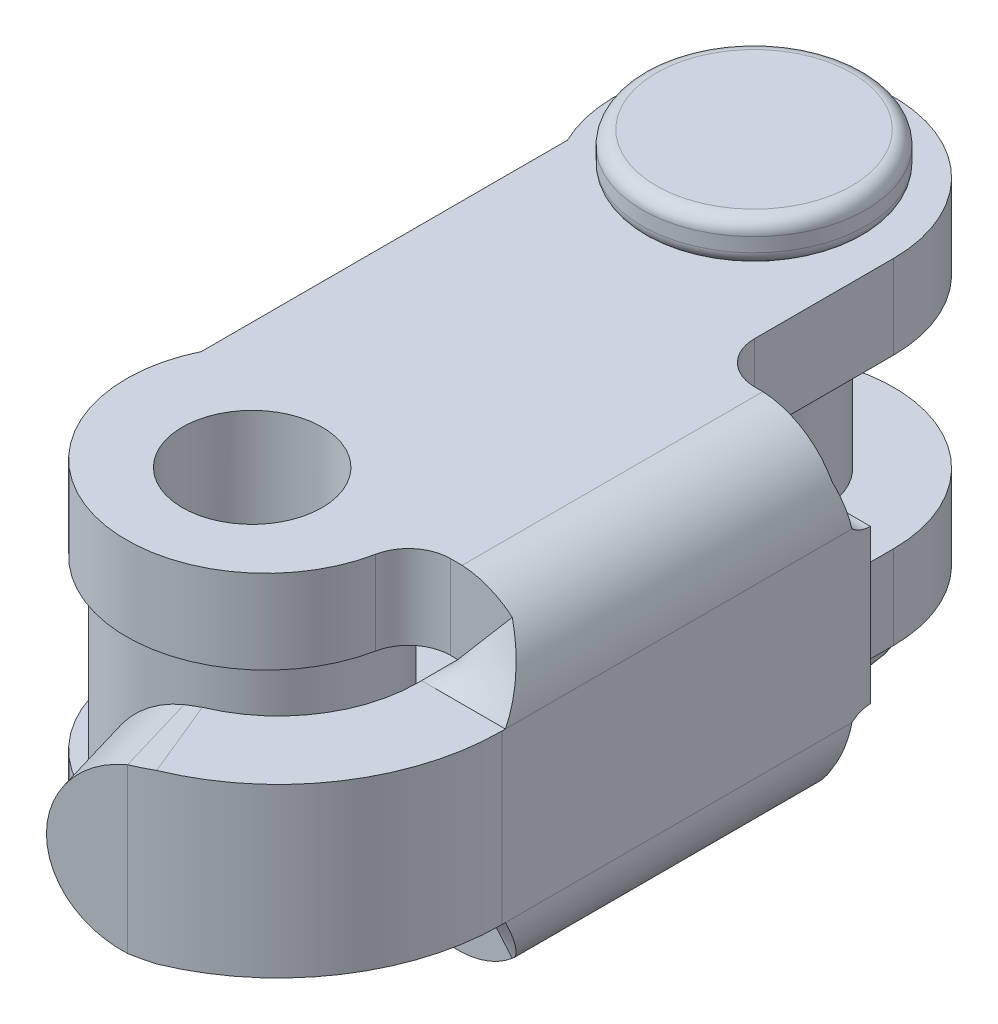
ISO-10303-21;
HEADER;
FILE_DESCRIPTION(('STEP AP214'),'2;1');
FILE_NAME('part.step','',(''),(''),'','','');
FILE_SCHEMA(('AUTOMOTIVE_DESIGN { 1 0 10303 214 1 1 1 1 }'));
ENDSEC;
DATA;
#1=APPLICATION_CONTEXT('core data for automotive mechanical design processes');
#2=APPLICATION_PROTOCOL_DEFINITION('international standard','automotive_design',2000,#1);
#3=PRODUCT_CONTEXT('',#1,'mechanical');
#4=PRODUCT('Part','Part','',(#3));
#5=PRODUCT_RELATED_PRODUCT_CATEGORY('part','',(#4));
#6=PRODUCT_DEFINITION_FORMATION('','',#4);
#7=PRODUCT_DEFINITION_CONTEXT('part definition',#1,'design');
#8=PRODUCT_DEFINITION('design','',#6,#7);
#9=PRODUCT_DEFINITION_SHAPE('','',#8);
#10=(LENGTH_UNIT() NAMED_UNIT(*) SI_UNIT(.MILLI.,.METRE.));
#11=(NAMED_UNIT(*) PLANE_ANGLE_UNIT() SI_UNIT($,.RADIAN.));
#12=(NAMED_UNIT(*) SI_UNIT($,.STERADIAN.) SOLID_ANGLE_UNIT());
#13=UNCERTAINTY_MEASURE_WITH_UNIT(LENGTH_MEASURE(1.E-05),#10,'distance_accuracy_value','');
#14=(GEOMETRIC_REPRESENTATION_CONTEXT(3) GLOBAL_UNCERTAINTY_ASSIGNED_CONTEXT((#13)) GLOBAL_UNIT_ASSIGNED_CONTEXT((#10,
#11,#12)) REPRESENTATION_CONTEXT('',''));
#15=CARTESIAN_POINT('',(0.,0.,0.));
#16=DIRECTION('',(0.,0.,1.));
#17=DIRECTION('',(1.,0.,0.));
#18=AXIS2_PLACEMENT_3D('',#15,#16,#17);
#19=CARTESIAN_POINT('',(0.,7.49600000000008,0.));
#20=DIRECTION('',(0.,1.,0.));
#21=DIRECTION('',(-0.215249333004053,0.,-0.97655912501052));
#22=AXIS2_PLACEMENT_3D('',#19,#20,#21);
#23=PLANE('',#22);
#24=CARTESIAN_POINT('',(0.,7.49600000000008,0.));
#25=DIRECTION('',(0.,1.,0.));
#26=DIRECTION('',(-0.215249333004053,0.,-0.97655912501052));
#27=AXIS2_PLACEMENT_3D('',#24,#25,#26);
#28=CIRCLE('',#27,3.5);
#29=CARTESIAN_POINT('',(-0.753372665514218,7.49600000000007,-3.41795693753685));
#30=VERTEX_POINT('',#29);
#31=EDGE_CURVE('E603',#30,#30,#28,.T.);
#32=ORIENTED_EDGE('',*,*,#31,.T.);
#33=EDGE_LOOP('',(#32));
#34=FACE_BOUND('',#33,.T.);
#35=ADVANCED_FACE('F14',(#34),#23,.T.);
#36=CARTESIAN_POINT('',(0.,6.99600000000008,0.));
#37=DIRECTION('',(0.,1.,0.));
#38=DIRECTION('',(-0.215249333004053,0.,-0.97655912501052));
#39=AXIS2_PLACEMENT_3D('',#36,#37,#38);
#40=TOROIDAL_SURFACE('',#39,3.5,0.5);
#41=CARTESIAN_POINT('',(0.,6.99600000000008,0.));
#42=DIRECTION('',(0.,1.,0.));
#43=DIRECTION('',(-0.215249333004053,0.,-0.97655912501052));
#44=AXIS2_PLACEMENT_3D('',#41,#42,#43);
#45=CIRCLE('',#44,4.);
#46=CARTESIAN_POINT('',(-0.860997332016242,6.99600000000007,-3.90623650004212));
#47=VERTEX_POINT('',#46);
#48=EDGE_CURVE('E609',#47,#47,#45,.F.);
#49=ORIENTED_EDGE('',*,*,#48,.F.);
#50=EDGE_LOOP('',(#49));
#51=FACE_BOUND('',#50,.T.);
#52=ORIENTED_EDGE('',*,*,#31,.F.);
#53=EDGE_LOOP('',(#52));
#54=FACE_BOUND('',#53,.T.);
#55=ADVANCED_FACE('F734',(#51,#54),#40,.T.);
#56=CARTESIAN_POINT('',(0.,7.49600000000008,0.));
#57=DIRECTION('',(0.,-1.,0.));
#58=DIRECTION('',(0.215249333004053,0.,0.97655912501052));
#59=AXIS2_PLACEMENT_3D('',#56,#57,#58);
#60=CYLINDRICAL_SURFACE('',#59,4.);
#61=CARTESIAN_POINT('',(0.,6.49600000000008,0.));
#62=DIRECTION('',(0.,1.,0.));
#63=DIRECTION('',(-0.215249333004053,0.,-0.97655912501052));
#64=AXIS2_PLACEMENT_3D('',#61,#62,#63);
#65=CIRCLE('',#64,4.);
#66=CARTESIAN_POINT('',(-0.860997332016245,6.49600000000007,-3.90623650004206));
#67=VERTEX_POINT('',#66);
#68=EDGE_CURVE('E606',#67,#67,#65,.T.);
#69=ORIENTED_EDGE('',*,*,#68,.T.);
#70=EDGE_LOOP('',(#69));
#71=FACE_BOUND('',#70,.T.);
#72=ORIENTED_EDGE('',*,*,#48,.T.);
#73=EDGE_LOOP('',(#72));
#74=FACE_BOUND('',#73,.T.);
#75=ADVANCED_FACE('F741',(#71,#74),#60,.T.);
#76=CARTESIAN_POINT('',(0.,6.49600000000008,0.));
#77=DIRECTION('',(0.,1.,0.));
#78=DIRECTION('',(-0.215249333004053,0.,-0.97655912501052));
#79=AXIS2_PLACEMENT_3D('',#76,#77,#78);
#80=TOROIDAL_SURFACE('',#79,3.5,0.5);
#81=ORIENTED_EDGE('',*,*,#68,.F.);
#82=EDGE_LOOP('',(#81));
#83=FACE_BOUND('',#82,.T.);
#84=CARTESIAN_POINT('',(0.,6.0000000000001,0.));
#85=DIRECTION('',(0.,-1.,0.));
#86=DIRECTION('',(-0.0983953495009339,0.,0.995147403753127));
#87=AXIS2_PLACEMENT_3D('',#84,#85,#86);
#88=CIRCLE('',#87,3.5631189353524);
#89=CARTESIAN_POINT('',(-0.350594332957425,6.0000000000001,3.54582855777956));
#90=VERTEX_POINT('',#89);
#91=EDGE_CURVE('E600',#90,#90,#88,.F.);
#92=ORIENTED_EDGE('',*,*,#91,.T.);
#93=EDGE_LOOP('',(#92));
#94=FACE_BOUND('',#93,.T.);
#95=ADVANCED_FACE('F746',(#83,#94),#80,.T.);
#96=CARTESIAN_POINT('',(0.,6.00400000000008,0.));
#97=DIRECTION('',(0.,-1.,0.));
#98=DIRECTION('',(0.215249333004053,0.,0.97655912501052));
#99=AXIS2_PLACEMENT_3D('',#96,#97,#98);
#100=CYLINDRICAL_SURFACE('',#99,2.5);
#101=CARTESIAN_POINT('',(0.,-2.99999999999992,0.));
#102=DIRECTION('',(0.,1.,0.));
#103=DIRECTION('',(0.0983953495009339,0.,-0.995147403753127));
#104=AXIS2_PLACEMENT_3D('',#101,#102,#103);
#105=CIRCLE('',#104,2.5);
#106=CARTESIAN_POINT('',(0.24598837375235,-2.99999999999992,-2.48786850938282));
#107=VERTEX_POINT('',#106);
#108=EDGE_CURVE('E27',#107,#107,#105,.F.);
#109=ORIENTED_EDGE('',*,*,#108,.F.);
#110=EDGE_LOOP('',(#109));
#111=FACE_BOUND('',#110,.T.);
#112=CARTESIAN_POINT('',(0.,3.0000000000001,0.));
#113=DIRECTION('',(0.,1.,0.));
#114=DIRECTION('',(0.0983953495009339,0.,-0.995147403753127));
#115=AXIS2_PLACEMENT_3D('',#112,#113,#114);
#116=CIRCLE('',#115,2.5);
#117=CARTESIAN_POINT('',(0.245988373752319,3.00000000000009,-2.48786850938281));
#118=VERTEX_POINT('',#117);
#119=EDGE_CURVE('E597',#118,#118,#116,.F.);
#120=ORIENTED_EDGE('',*,*,#119,.T.);
#121=EDGE_LOOP('',(#120));
#122=FACE_BOUND('',#121,.T.);
#123=ADVANCED_FACE('F750',(#111,#122),#100,.T.);
#124=CARTESIAN_POINT('',(0.,-6.00399999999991,0.));
#125=DIRECTION('',(0.,-1.,0.));
#126=DIRECTION('',(0.215249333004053,0.,0.97655912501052));
#127=AXIS2_PLACEMENT_3D('',#124,#125,#126);
#128=CIRCLE('',#127,2.5);
#129=CARTESIAN_POINT('',(0.538123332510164,-6.0039999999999,2.44139781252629));
#130=VERTEX_POINT('',#129);
#131=EDGE_CURVE('E612',#130,#130,#128,.F.);
#132=ORIENTED_EDGE('',*,*,#131,.T.);
#133=EDGE_LOOP('',(#132));
#134=FACE_BOUND('',#133,.T.);
#135=CARTESIAN_POINT('',(0.,-5.99999999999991,0.));
#136=DIRECTION('',(0.,1.,0.));
#137=DIRECTION('',(-1.,0.,0.));
#138=AXIS2_PLACEMENT_3D('',#135,#136,#137);
#139=CIRCLE('',#138,2.5);
#140=CARTESIAN_POINT('',(-2.49999999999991,-5.99999999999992,0.));
#141=VERTEX_POINT('',#140);
#142=EDGE_CURVE('E9',#141,#141,#139,.F.);
#143=ORIENTED_EDGE('',*,*,#142,.T.);
#144=EDGE_LOOP('',(#143));
#145=FACE_BOUND('',#144,.T.);
#146=ADVANCED_FACE('F748',(#134,#145),#100,.T.);
#147=CARTESIAN_POINT('',(0.,-7.504,0.));
#148=DIRECTION('',(0.,1.,0.));
#149=DIRECTION('',(-0.215249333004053,0.,-0.97655912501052));
#150=AXIS2_PLACEMENT_3D('',#147,#148,#149);
#151=PLANE('',#150);
#152=CARTESIAN_POINT('',(0.,-7.5039999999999,0.));
#153=DIRECTION('',(0.,1.,0.));
#154=DIRECTION('',(-0.215249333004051,0.,-0.976559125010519));
#155=AXIS2_PLACEMENT_3D('',#152,#153,#154);
#156=CIRCLE('',#155,3.50000000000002);
#157=CARTESIAN_POINT('',(-0.75337266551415,-7.504,-3.4179569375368));
#158=VERTEX_POINT('',#157);
#159=CARTESIAN_POINT('',(0.753372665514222,-7.504,3.41795693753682));
#160=VERTEX_POINT('',#159);
#161=EDGE_CURVE('E594',#158,#160,#156,.T.);
#162=ORIENTED_EDGE('',*,*,#161,.F.);
#163=CARTESIAN_POINT('',(0.,-7.5039999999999,0.));
#164=DIRECTION('',(0.,1.,0.));
#165=DIRECTION('',(0.215249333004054,0.,0.976559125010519));
#166=AXIS2_PLACEMENT_3D('',#163,#164,#165);
#167=CIRCLE('',#166,3.50000000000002);
#168=EDGE_CURVE('E645',#160,#158,#167,.T.);
#169=ORIENTED_EDGE('',*,*,#168,.F.);
#170=EDGE_LOOP('',(#162,#169));
#171=FACE_BOUND('',#170,.T.);
#172=ADVANCED_FACE('F630',(#171),#151,.F.);
#173=CARTESIAN_POINT('',(0.,-7.0039999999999,0.));
#174=DIRECTION('',(0.,1.,0.));
#175=DIRECTION('',(-0.215249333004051,0.,-0.976559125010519));
#176=AXIS2_PLACEMENT_3D('',#173,#174,#175);
#177=TOROIDAL_SURFACE('',#176,3.50000000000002,0.5);
#178=ORIENTED_EDGE('',*,*,#161,.T.);
#179=ORIENTED_EDGE('',*,*,#168,.T.);
#180=EDGE_LOOP('',(#178,#179));
#181=FACE_BOUND('',#180,.T.);
#182=CARTESIAN_POINT('',(0.,-7.00399999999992,0.));
#183=DIRECTION('',(0.,-1.,0.));
#184=DIRECTION('',(0.215249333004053,0.,0.97655912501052));
#185=AXIS2_PLACEMENT_3D('',#182,#183,#184);
#186=CIRCLE('',#185,4.);
#187=CARTESIAN_POINT('',(0.860997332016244,-7.00399999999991,3.90623650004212));
#188=VERTEX_POINT('',#187);
#189=EDGE_CURVE('E642',#188,#188,#186,.F.);
#190=ORIENTED_EDGE('',*,*,#189,.F.);
#191=EDGE_LOOP('',(#190));
#192=FACE_BOUND('',#191,.T.);
#193=ADVANCED_FACE('F618',(#181,#192),#177,.T.);
#194=CARTESIAN_POINT('',(0.,-6.00399999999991,0.));
#195=DIRECTION('',(0.,-1.,0.));
#196=DIRECTION('',(0.215249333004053,0.,0.97655912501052));
#197=AXIS2_PLACEMENT_3D('',#194,#195,#196);
#198=CYLINDRICAL_SURFACE('',#197,4.);
#199=CARTESIAN_POINT('',(0.,-6.50399999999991,0.));
#200=DIRECTION('',(0.,1.,0.));
#201=DIRECTION('',(-0.215249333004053,0.,-0.97655912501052));
#202=AXIS2_PLACEMENT_3D('',#199,#200,#201);
#203=CIRCLE('',#202,4.);
#204=CARTESIAN_POINT('',(-0.860997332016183,-6.50399999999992,-3.90623650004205));
#205=VERTEX_POINT('',#204);
#206=EDGE_CURVE('E640',#205,#205,#203,.T.);
#207=ORIENTED_EDGE('',*,*,#206,.F.);
#208=EDGE_LOOP('',(#207));
#209=FACE_BOUND('',#208,.T.);
#210=ORIENTED_EDGE('',*,*,#189,.T.);
#211=EDGE_LOOP('',(#210));
#212=FACE_BOUND('',#211,.T.);
#213=ADVANCED_FACE('F629',(#209,#212),#198,.T.);
#214=CARTESIAN_POINT('',(0.,-6.5039999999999,0.));
#215=DIRECTION('',(0.,1.,0.));
#216=DIRECTION('',(-0.215249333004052,0.,-0.976559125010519));
#217=AXIS2_PLACEMENT_3D('',#214,#215,#216);
#218=TOROIDAL_SURFACE('',#217,3.50000000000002,0.5);
#219=ORIENTED_EDGE('',*,*,#206,.T.);
#220=EDGE_LOOP('',(#219));
#221=FACE_BOUND('',#220,.T.);
#222=CARTESIAN_POINT('',(0.,-6.0039999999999,0.));
#223=DIRECTION('',(0.,-1.,0.));
#224=DIRECTION('',(-0.215249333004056,0.,-0.976559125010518));
#225=AXIS2_PLACEMENT_3D('',#222,#223,#224);
#226=CIRCLE('',#225,3.50000000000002);
#227=CARTESIAN_POINT('',(0.753372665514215,-6.00399999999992,3.41795693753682));
#228=VERTEX_POINT('',#227);
#229=CARTESIAN_POINT('',(-0.753372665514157,-6.00399999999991,-3.4179569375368));
#230=VERTEX_POINT('',#229);
#231=EDGE_CURVE('E35',#228,#230,#226,.F.);
#232=ORIENTED_EDGE('',*,*,#231,.F.);
#233=CARTESIAN_POINT('',(0.,-6.0039999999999,0.));
#234=DIRECTION('',(0.,-1.,0.));
#235=DIRECTION('',(0.215249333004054,0.,0.976559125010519));
#236=AXIS2_PLACEMENT_3D('',#233,#234,#235);
#237=CIRCLE('',#236,3.50000000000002);
#238=EDGE_CURVE('E677',#230,#228,#237,.F.);
#239=ORIENTED_EDGE('',*,*,#238,.F.);
#240=EDGE_LOOP('',(#232,#239));
#241=FACE_BOUND('',#240,.T.);
#242=ADVANCED_FACE('F680',(#221,#241),#218,.T.);
#243=CARTESIAN_POINT('',(0.,-6.00399999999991,0.));
#244=DIRECTION('',(0.,1.,0.));
#245=DIRECTION('',(-0.215249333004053,0.,-0.97655912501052));
#246=AXIS2_PLACEMENT_3D('',#243,#244,#245);
#247=PLANE('',#246);
#248=ORIENTED_EDGE('',*,*,#131,.F.);
#249=EDGE_LOOP('',(#248));
#250=FACE_BOUND('',#249,.T.);
#251=ORIENTED_EDGE('',*,*,#238,.T.);
#252=ORIENTED_EDGE('',*,*,#231,.T.);
#253=EDGE_LOOP('',(#251,#252));
#254=FACE_BOUND('',#253,.T.);
#255=ADVANCED_FACE('F690',(#250,#254),#247,.T.);
#256=CARTESIAN_POINT('',(3.69866492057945,1.42537237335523E-13,23.2724078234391));
#257=DIRECTION('',(0.284015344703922,0.,0.958819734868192));
#258=DIRECTION('',(-0.958819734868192,0.,0.284015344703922));
#259=AXIS2_PLACEMENT_3D('',#256,#257,#258);
#260=CYLINDRICAL_SURFACE('',#259,3.00000000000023);
#261=CARTESIAN_POINT('',(4.55071095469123,1.48303238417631E-13,26.1488670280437));
#262=DIRECTION('',(0.284015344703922,0.,0.958819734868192));
#263=DIRECTION('',(-0.958819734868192,0.,0.284015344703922));
#264=AXIS2_PLACEMENT_3D('',#261,#262,#263);
#265=CIRCLE('',#264,3.00000000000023);
#266=CARTESIAN_POINT('',(3.91364508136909,-2.92549765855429,26.3375745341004));
#267=VERTEX_POINT('',#266);
#268=CARTESIAN_POINT('',(3.91364508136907,2.92549765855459,26.3375745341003));
#269=VERTEX_POINT('',#268);
#270=EDGE_CURVE('E313',#267,#269,#265,.F.);
#271=ORIENTED_EDGE('',*,*,#270,.T.);
#272=DIRECTION('',(0.284015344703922,0.,0.958819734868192));
#273=VECTOR('',#272,1.);
#274=CARTESIAN_POINT('',(3.06159904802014,2.92549765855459,23.461115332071));
#275=LINE('',#274,#273);
#276=CARTESIAN_POINT('',(3.0615990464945,2.92549765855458,23.4611153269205));
#277=VERTEX_POINT('',#276);
#278=EDGE_CURVE('E354',#269,#277,#275,.F.);
#279=ORIENTED_EDGE('',*,*,#278,.T.);
#280=CARTESIAN_POINT('',(3.6986649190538,1.42537237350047E-13,23.2724078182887));
#281=DIRECTION('',(0.284015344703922,0.,0.958819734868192));
#282=DIRECTION('',(-0.958819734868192,0.,0.284015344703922));
#283=AXIS2_PLACEMENT_3D('',#280,#281,#282);
#284=CIRCLE('',#283,3.00000000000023);
#285=CARTESIAN_POINT('',(3.06159904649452,-2.92549765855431,23.4611153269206));
#286=VERTEX_POINT('',#285);
#287=EDGE_CURVE('E423',#286,#277,#284,.F.);
#288=ORIENTED_EDGE('',*,*,#287,.F.);
#289=DIRECTION('',(0.284015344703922,0.,0.958819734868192));
#290=VECTOR('',#289,1.);
#291=CARTESIAN_POINT('',(3.48762206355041,-2.92549765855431,24.8993449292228));
#292=LINE('',#291,#290);
#293=EDGE_CURVE('E878',#286,#267,#292,.T.);
#294=ORIENTED_EDGE('',*,*,#293,.T.);
#295=EDGE_LOOP('',(#271,#279,#288,#294));
#296=FACE_BOUND('',#295,.T.);
#297=ADVANCED_FACE('F339',(#296),#260,.T.);
#298=CARTESIAN_POINT('',(10.9856949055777,-5.62695571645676,21.1138912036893));
#299=DIRECTION('',(-0.284015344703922,0.,-0.958819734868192));
#300=DIRECTION('',(0.958819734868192,0.,-0.284015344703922));
#301=AXIS2_PLACEMENT_3D('',#298,#299,#300);
#302=PLANE('',#301);
#303=DIRECTION('',(0.,1.,0.));
#304=VECTOR('',#303,1.);
#305=CARTESIAN_POINT('',(3.06159904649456,-10.7017485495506,23.4611153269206));
#306=LINE('',#305,#304);
#307=EDGE_CURVE('E425',#277,#286,#306,.F.);
#308=ORIENTED_EDGE('',*,*,#307,.T.);
#309=ORIENTED_EDGE('',*,*,#287,.T.);
#310=EDGE_LOOP('',(#308,#309));
#311=FACE_BOUND('',#310,.T.);
#312=ADVANCED_FACE('F766',(#311),#302,.T.);
#313=CARTESIAN_POINT('',(11.8377409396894,-5.62695571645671,23.9903504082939));
#314=DIRECTION('',(-0.284015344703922,0.,-0.958819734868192));
#315=DIRECTION('',(0.958819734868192,0.,-0.284015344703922));
#316=AXIS2_PLACEMENT_3D('',#313,#314,#315);
#317=PLANE('',#316);
#318=DIRECTION('',(0.,1.,0.));
#319=VECTOR('',#318,1.);
#320=CARTESIAN_POINT('',(3.91364508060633,-10.7017485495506,26.3375745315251));
#321=LINE('',#320,#319);
#322=EDGE_CURVE('E352',#269,#267,#321,.F.);
#323=ORIENTED_EDGE('',*,*,#322,.F.);
#324=ORIENTED_EDGE('',*,*,#270,.F.);
#325=EDGE_LOOP('',(#323,#324));
#326=FACE_BOUND('',#325,.T.);
#327=ADVANCED_FACE('F775',(#326),#317,.F.);
#328=CARTESIAN_POINT('',(4.68450122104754,-3.00000000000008,26.0656840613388));
#329=CARTESIAN_POINT('',(4.43240421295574,-2.97516580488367,26.1693683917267));
#330=CARTESIAN_POINT('',(4.17500629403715,-2.95033185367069,26.2601558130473));
#331=CARTESIAN_POINT('',(3.91364508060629,-2.92549765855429,26.3375745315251));
#332=CARTESIAN_POINT('',(3.5433841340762,-3.00000000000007,23.2911837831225));
#333=CARTESIAN_POINT('',(3.38582351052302,-2.97516580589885,23.3559864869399));
#334=CARTESIAN_POINT('',(3.2249497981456,-2.95033185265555,23.4127286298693));
#335=CARTESIAN_POINT('',(3.06159904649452,-2.92549765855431,23.4611153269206));
#336=B_SPLINE_SURFACE_WITH_KNOTS('',1,3,((#328,#329,#330,#331),(#332,#333,#334,#335)),
.UNSPECIFIED.,.F.,.F.,.F.,(2,2),(4,4),(0.,1.),(0.,1.),.UNSPECIFIED.);
#337=CARTESIAN_POINT('',(3.9136450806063,-2.92549765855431,26.3375745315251));
#338=CARTESIAN_POINT('',(3.94631512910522,-2.92860192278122,26.3278972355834));
#339=CARTESIAN_POINT('',(3.97892334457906,-2.93170618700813,26.3180111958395));
#340=CARTESIAN_POINT('',(4.04401080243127,-2.93791471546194,26.2978232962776));
#341=CARTESIAN_POINT('',(4.07649004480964,-2.94101897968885,26.2875214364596));
#342=CARTESIAN_POINT('',(4.14131424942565,-2.94722750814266,26.2665035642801));
#343=CARTESIAN_POINT('',(4.17365921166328,-2.95033177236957,26.2557875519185));
#344=CARTESIAN_POINT('',(4.23820957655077,-2.95654030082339,26.2339431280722));
#345=CARTESIAN_POINT('',(4.27041497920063,-2.95964456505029,26.2228147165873));
#346=CARTESIAN_POINT('',(4.33468096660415,-2.96585309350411,26.2001473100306));
#347=CARTESIAN_POINT('',(4.3667415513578,-2.96895735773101,26.1886083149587));
#348=CARTESIAN_POINT('',(4.4307126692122,-2.97516588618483,26.1651216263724));
#349=CARTESIAN_POINT('',(4.46262320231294,-2.97827015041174,26.1531739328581));
#350=CARTESIAN_POINT('',(4.52628900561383,-2.98447867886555,26.128871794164));
#351=CARTESIAN_POINT('',(4.55804427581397,-2.98758294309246,26.1165173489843));
#352=CARTESIAN_POINT('',(4.62139437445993,-2.99379147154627,26.0914037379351));
#353=CARTESIAN_POINT('',(4.65298920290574,-2.99689573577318,26.0786445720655));
#354=CARTESIAN_POINT('',(4.68450122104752,-3.00000000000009,26.0656840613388));
#355=B_SPLINE_CURVE_WITH_KNOTS('',3,(#337,#338,#339,#340,#341,#342,#343,#344,#345,#346,#347,
#348,#349,#350,#351,#352,#353,#354),.UNSPECIFIED.,.F.,.F.,(4,2,2,2,2,2,2,2,4),(0.,
0.102642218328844,0.205284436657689,0.307926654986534,0.410568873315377,0.513211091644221,
0.615853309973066,0.718495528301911,0.821137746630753),.UNSPECIFIED.);
#356=CARTESIAN_POINT('',(4.68450122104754,-3.00000000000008,26.0656840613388));
#357=VERTEX_POINT('',#356);
#358=EDGE_CURVE('E312',#267,#357,#355,.T.);
#359=CARTESIAN_POINT('',(3.06159904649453,-2.92549765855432,23.4611153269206));
#360=CARTESIAN_POINT('',(3.08201782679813,-2.92860192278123,23.4550670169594));
#361=CARTESIAN_POINT('',(3.10239796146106,-2.93170618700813,23.448888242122));
#362=CARTESIAN_POINT('',(3.14307762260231,-2.93791471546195,23.4362708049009));
#363=CARTESIAN_POINT('',(3.16337714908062,-2.94101897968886,23.4298321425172));
#364=CARTESIAN_POINT('',(3.2038922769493,-2.94722750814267,23.4166959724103));
#365=CARTESIAN_POINT('',(3.22410787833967,-2.95033177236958,23.409998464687));
#366=CARTESIAN_POINT('',(3.2644518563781,-2.95654030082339,23.3963456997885));
#367=CARTESIAN_POINT('',(3.28458023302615,-2.9596445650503,23.3893904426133));
#368=CARTESIAN_POINT('',(3.32474647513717,-2.96585309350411,23.3752233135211));
#369=CARTESIAN_POINT('',(3.34478434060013,-2.96895735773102,23.368011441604));
#370=CARTESIAN_POINT('',(3.38476628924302,-2.97516588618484,23.3533322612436));
#371=CARTESIAN_POINT('',(3.40471037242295,-2.97827015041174,23.3458649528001));
#372=CARTESIAN_POINT('',(3.44450149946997,-2.98447867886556,23.3306761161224));
#373=CARTESIAN_POINT('',(3.46434854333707,-2.98758294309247,23.3229545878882));
#374=CARTESIAN_POINT('',(3.50394235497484,-2.99379147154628,23.3072585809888));
#375=CARTESIAN_POINT('',(3.52368912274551,-2.99689573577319,23.2992841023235));
#376=CARTESIAN_POINT('',(3.54338413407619,-3.0000000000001,23.2911837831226));
#377=B_SPLINE_CURVE_WITH_KNOTS('',3,(#359,#360,#361,#362,#363,#364,#365,#366,#367,#368,#369,
#370,#371,#372,#373,#374,#375,#376),.UNSPECIFIED.,.F.,.F.,(4,2,2,2,2,2,2,2,4),(0.,
0.0645619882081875,0.129123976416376,0.193685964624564,0.258247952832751,0.322809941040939,
0.387371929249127,0.451933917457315,0.516495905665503),.UNSPECIFIED.);
#378=CARTESIAN_POINT('',(3.5433841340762,-3.00000000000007,23.2911837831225));
#379=VERTEX_POINT('',#378);
#380=EDGE_CURVE('E875',#379,#286,#377,.F.);
#381=DIRECTION('',(0.380372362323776,0.,0.924833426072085));
#382=VECTOR('',#381,1.);
#383=CARTESIAN_POINT('',(3.5433841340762,-3.00000000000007,23.2911837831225));
#384=LINE('',#383,#382);
#385=EDGE_CURVE('E435',#379,#357,#384,.T.);
#386=ORIENTED_EDGE('',*,*,#358,.F.);
#387=ORIENTED_EDGE('',*,*,#293,.F.);
#388=ORIENTED_EDGE('',*,*,#380,.F.);
#389=ORIENTED_EDGE('',*,*,#385,.T.);
#390=EDGE_LOOP('',(#386,#387,#388,#389));
#391=FACE_BOUND('',#390,.T.);
#392=ADVANCED_FACE('F769',(#391),#336,.F.);
#393=CARTESIAN_POINT('',(3.91364508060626,2.92549765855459,26.3375745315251));
#394=CARTESIAN_POINT('',(4.17500629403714,2.95033185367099,26.2601558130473));
#395=CARTESIAN_POINT('',(4.43240421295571,2.97516580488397,26.1693683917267));
#396=CARTESIAN_POINT('',(4.68450122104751,3.00000000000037,26.0656840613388));
#397=CARTESIAN_POINT('',(3.0615990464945,2.92549765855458,23.4611153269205));
#398=CARTESIAN_POINT('',(3.22494979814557,2.95033185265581,23.4127286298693));
#399=CARTESIAN_POINT('',(3.38582351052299,2.97516580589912,23.3559864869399));
#400=CARTESIAN_POINT('',(3.54338413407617,3.00000000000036,23.2911837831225));
#401=B_SPLINE_SURFACE_WITH_KNOTS('',1,3,((#393,#394,#395,#396),(#397,#398,#399,#400)),
.UNSPECIFIED.,.F.,.F.,.F.,(2,2),(4,4),(0.,1.),(0.,1.),.UNSPECIFIED.);
#402=CARTESIAN_POINT('',(4.68450122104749,3.00000000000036,26.0656840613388));
#403=CARTESIAN_POINT('',(4.65298920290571,2.99689573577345,26.0786445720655));
#404=CARTESIAN_POINT('',(4.6213943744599,2.99379147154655,26.0914037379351));
#405=CARTESIAN_POINT('',(4.55804427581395,2.98758294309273,26.1165173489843));
#406=CARTESIAN_POINT('',(4.5262890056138,2.98447867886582,26.128871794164));
#407=CARTESIAN_POINT('',(4.46262320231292,2.97827015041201,26.1531739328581));
#408=CARTESIAN_POINT('',(4.43071266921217,2.9751658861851,26.1651216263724));
#409=CARTESIAN_POINT('',(4.36674155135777,2.96895735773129,26.1886083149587));
#410=CARTESIAN_POINT('',(4.33468096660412,2.96585309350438,26.2001473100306));
#411=CARTESIAN_POINT('',(4.2704149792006,2.95964456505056,26.2228147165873));
#412=CARTESIAN_POINT('',(4.23820957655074,2.95654030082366,26.2339431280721));
#413=CARTESIAN_POINT('',(4.17365921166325,2.95033177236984,26.2557875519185));
#414=CARTESIAN_POINT('',(4.14131424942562,2.94722750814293,26.2665035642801));
#415=CARTESIAN_POINT('',(4.07649004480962,2.94101897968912,26.2875214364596));
#416=CARTESIAN_POINT('',(4.04401080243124,2.93791471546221,26.2978232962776));
#417=CARTESIAN_POINT('',(3.97892334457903,2.9317061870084,26.3180111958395));
#418=CARTESIAN_POINT('',(3.94631512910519,2.92860192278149,26.3278972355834));
#419=CARTESIAN_POINT('',(3.91364508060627,2.92549765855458,26.3375745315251));
#420=B_SPLINE_CURVE_WITH_KNOTS('',3,(#402,#403,#404,#405,#406,#407,#408,#409,#410,#411,#412,
#413,#414,#415,#416,#417,#418,#419),.UNSPECIFIED.,.F.,.F.,(4,2,2,2,2,2,2,2,4),(0.,
0.102642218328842,0.205284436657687,0.307926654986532,0.410568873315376,0.513211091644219,
0.615853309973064,0.71849552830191,0.821137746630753),.UNSPECIFIED.);
#421=CARTESIAN_POINT('',(4.68450122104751,3.00000000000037,26.0656840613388));
#422=VERTEX_POINT('',#421);
#423=EDGE_CURVE('E347',#422,#269,#420,.T.);
#424=DIRECTION('',(-0.380372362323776,0.,-0.924833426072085));
#425=VECTOR('',#424,1.);
#426=CARTESIAN_POINT('',(4.68450122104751,3.00000000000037,26.0656840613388));
#427=LINE('',#426,#425);
#428=CARTESIAN_POINT('',(3.54338413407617,3.00000000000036,23.2911837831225));
#429=VERTEX_POINT('',#428);
#430=EDGE_CURVE('E420',#422,#429,#427,.T.);
#431=CARTESIAN_POINT('',(3.54338413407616,3.00000000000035,23.2911837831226));
#432=CARTESIAN_POINT('',(3.52368912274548,2.99689573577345,23.2992841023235));
#433=CARTESIAN_POINT('',(3.50394235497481,2.99379147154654,23.3072585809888));
#434=CARTESIAN_POINT('',(3.46434854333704,2.98758294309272,23.3229545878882));
#435=CARTESIAN_POINT('',(3.44450149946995,2.98447867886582,23.3306761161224));
#436=CARTESIAN_POINT('',(3.40471037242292,2.978270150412,23.3458649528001));
#437=CARTESIAN_POINT('',(3.38476628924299,2.97516588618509,23.3533322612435));
#438=CARTESIAN_POINT('',(3.3447843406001,2.96895735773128,23.368011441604));
#439=CARTESIAN_POINT('',(3.32474647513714,2.96585309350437,23.3752233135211));
#440=CARTESIAN_POINT('',(3.28458023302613,2.95964456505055,23.3893904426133));
#441=CARTESIAN_POINT('',(3.26445185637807,2.95654030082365,23.3963456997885));
#442=CARTESIAN_POINT('',(3.22410787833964,2.95033177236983,23.409998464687));
#443=CARTESIAN_POINT('',(3.20389227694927,2.94722750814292,23.4166959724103));
#444=CARTESIAN_POINT('',(3.16337714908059,2.94101897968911,23.4298321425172));
#445=CARTESIAN_POINT('',(3.14307762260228,2.9379147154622,23.4362708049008));
#446=CARTESIAN_POINT('',(3.10239796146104,2.93170618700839,23.448888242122));
#447=CARTESIAN_POINT('',(3.0820178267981,2.92860192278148,23.4550670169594));
#448=CARTESIAN_POINT('',(3.0615990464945,2.92549765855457,23.4611153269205));
#449=B_SPLINE_CURVE_WITH_KNOTS('',3,(#431,#432,#433,#434,#435,#436,#437,#438,#439,#440,#441,
#442,#443,#444,#445,#446,#447,#448),.UNSPECIFIED.,.F.,.F.,(4,2,2,2,2,2,2,2,4),(0.,
0.0645619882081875,0.129123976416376,0.193685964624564,0.258247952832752,0.322809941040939,
0.387371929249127,0.451933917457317,0.516495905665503),.UNSPECIFIED.);
#450=EDGE_CURVE('E367',#277,#429,#449,.F.);
#451=ORIENTED_EDGE('',*,*,#423,.F.);
#452=ORIENTED_EDGE('',*,*,#430,.T.);
#453=ORIENTED_EDGE('',*,*,#450,.F.);
#454=ORIENTED_EDGE('',*,*,#278,.F.);
#455=EDGE_LOOP('',(#451,#452,#453,#454));
#456=FACE_BOUND('',#455,.T.);
#457=ADVANCED_FACE('F768',(#456),#401,.F.);
#458=CARTESIAN_POINT('',(1.64152232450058,-10.7017485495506,18.66701665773));
#459=DIRECTION('',(0.,1.,0.));
#460=DIRECTION('',(-1.,0.,0.));
#461=AXIS2_PLACEMENT_3D('',#458,#459,#460);
#462=CYLINDRICAL_SURFACE('',#461,4.99999999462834);
#463=CARTESIAN_POINT('',(1.64152232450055,-3.00000000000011,18.66701665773));
#464=DIRECTION('',(0.,1.,0.));
#465=DIRECTION('',(-1.,0.,0.));
#466=AXIS2_PLACEMENT_3D('',#463,#464,#465);
#467=CIRCLE('',#466,4.99999999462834);
#468=CARTESIAN_POINT('',(6.64152232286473,-3.00000000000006,18.66701665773));
#469=VERTEX_POINT('',#468);
#470=EDGE_CURVE('E428',#379,#469,#467,.T.);
#471=ORIENTED_EDGE('',*,*,#470,.F.);
#472=ORIENTED_EDGE('',*,*,#380,.T.);
#473=ORIENTED_EDGE('',*,*,#307,.F.);
#474=ORIENTED_EDGE('',*,*,#450,.T.);
#475=CARTESIAN_POINT('',(1.64152232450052,3.00000000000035,18.66701665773));
#476=DIRECTION('',(0.,1.,0.));
#477=DIRECTION('',(-1.,0.,0.));
#478=AXIS2_PLACEMENT_3D('',#475,#476,#477);
#479=CIRCLE('',#478,4.99999999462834);
#480=CARTESIAN_POINT('',(6.64152232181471,3.00000000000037,18.66701665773));
#481=VERTEX_POINT('',#480);
#482=EDGE_CURVE('E429',#481,#429,#479,.F.);
#483=ORIENTED_EDGE('',*,*,#482,.F.);
#484=DIRECTION('',(0.,-1.,0.));
#485=VECTOR('',#484,1.);
#486=CARTESIAN_POINT('',(6.64152232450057,-5.62695571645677,18.66701665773));
#487=LINE('',#486,#485);
#488=EDGE_CURVE('E430',#469,#481,#487,.F.);
#489=ORIENTED_EDGE('',*,*,#488,.F.);
#490=EDGE_LOOP('',(#471,#472,#473,#474,#483,#489));
#491=FACE_BOUND('',#490,.T.);
#492=ADVANCED_FACE('F779',(#491),#462,.F.);
#493=CARTESIAN_POINT('',(1.64152232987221,-3.00000000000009,18.66701665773));
#494=DIRECTION('',(0.,1.,0.));
#495=DIRECTION('',(-1.,0.,0.));
#496=AXIS2_PLACEMENT_3D('',#493,#494,#495);
#497=PLANE('',#496);
#498=ORIENTED_EDGE('',*,*,#385,.F.);
#499=ORIENTED_EDGE('',*,*,#470,.T.);
#500=DIRECTION('',(0.,0.,1.));
#501=VECTOR('',#500,1.);
#502=CARTESIAN_POINT('',(6.64152232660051,-3.00000000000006,18.5409));
#503=LINE('',#502,#501);
#504=CARTESIAN_POINT('',(6.64152232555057,-3.00000000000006,18.5409));
#505=VERTEX_POINT('',#504);
#506=EDGE_CURVE('E879',#505,#469,#503,.T.);
#507=ORIENTED_EDGE('',*,*,#506,.F.);
#508=DIRECTION('',(-1.,0.,0.));
#509=VECTOR('',#508,1.);
#510=CARTESIAN_POINT('',(6.64152232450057,-3.00000000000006,18.5409));
#511=LINE('',#510,#509);
#512=CARTESIAN_POINT('',(9.64152232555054,-3.00000000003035,18.5409000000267));
#513=VERTEX_POINT('',#512);
#514=EDGE_CURVE('E883',#513,#505,#511,.T.);
#515=ORIENTED_EDGE('',*,*,#514,.F.);
#516=DIRECTION('',(0.,0.,1.));
#517=VECTOR('',#516,1.);
#518=CARTESIAN_POINT('',(9.64152232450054,-3.00000000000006,18.5409));
#519=LINE('',#518,#517);
#520=CARTESIAN_POINT('',(9.6415223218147,-3.00000000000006,18.66701665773));
#521=VERTEX_POINT('',#520);
#522=EDGE_CURVE('E969',#521,#513,#519,.F.);
#523=ORIENTED_EDGE('',*,*,#522,.F.);
#524=CARTESIAN_POINT('',(1.64152232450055,-3.00000000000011,18.66701665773));
#525=DIRECTION('',(0.,1.,0.));
#526=DIRECTION('',(-1.,0.,0.));
#527=AXIS2_PLACEMENT_3D('',#524,#525,#526);
#528=CIRCLE('',#527,7.99999999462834);
#529=EDGE_CURVE('E417',#357,#521,#528,.T.);
#530=ORIENTED_EDGE('',*,*,#529,.F.);
#531=EDGE_LOOP('',(#498,#499,#507,#515,#523,#530));
#532=FACE_BOUND('',#531,.T.);
#533=ADVANCED_FACE('F336',(#532),#497,.F.);
#534=CARTESIAN_POINT('',(1.64152232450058,-10.7017485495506,18.66701665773));
#535=DIRECTION('',(0.,1.,0.));
#536=DIRECTION('',(-1.,0.,0.));
#537=AXIS2_PLACEMENT_3D('',#534,#535,#536);
#538=CYLINDRICAL_SURFACE('',#537,7.99999999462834);
#539=ORIENTED_EDGE('',*,*,#358,.T.);
#540=ORIENTED_EDGE('',*,*,#529,.T.);
#541=DIRECTION('',(0.,-1.,0.));
#542=VECTOR('',#541,1.);
#543=CARTESIAN_POINT('',(9.64152232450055,-5.62695571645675,18.66701665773));
#544=LINE('',#543,#542);
#545=CARTESIAN_POINT('',(9.64152232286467,3.00000000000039,18.66701665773));
#546=VERTEX_POINT('',#545);
#547=EDGE_CURVE('E444',#521,#546,#544,.F.);
#548=ORIENTED_EDGE('',*,*,#547,.T.);
#549=CARTESIAN_POINT('',(1.64152232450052,3.00000000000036,18.66701665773));
#550=DIRECTION('',(0.,1.,0.));
#551=DIRECTION('',(-1.,0.,0.));
#552=AXIS2_PLACEMENT_3D('',#549,#550,#551);
#553=CIRCLE('',#552,7.99999999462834);
#554=EDGE_CURVE('E424',#546,#422,#553,.F.);
#555=ORIENTED_EDGE('',*,*,#554,.T.);
#556=ORIENTED_EDGE('',*,*,#423,.T.);
#557=ORIENTED_EDGE('',*,*,#322,.T.);
#558=EDGE_LOOP('',(#539,#540,#548,#555,#556,#557));
#559=FACE_BOUND('',#558,.T.);
#560=ADVANCED_FACE('F327',(#559),#538,.T.);
#561=CARTESIAN_POINT('',(6.64152232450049,3.75000000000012,5.47599999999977));
#562=DIRECTION('',(1.,0.,0.));
#563=DIRECTION('',(0.,1.,0.));
#564=AXIS2_PLACEMENT_3D('',#561,#562,#563);
#565=CYLINDRICAL_SURFACE('',#564,1.);
#566=DIRECTION('',(1.,0.,0.));
#567=VECTOR('',#566,1.);
#568=CARTESIAN_POINT('',(6.6415223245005,3.00000000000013,6.13743782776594));
#569=LINE('',#568,#567);
#570=CARTESIAN_POINT('',(9.64152232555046,3.00000000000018,6.13743782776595));
#571=VERTEX_POINT('',#570);
#572=CARTESIAN_POINT('',(6.64152232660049,3.00000000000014,6.13743782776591));
#573=VERTEX_POINT('',#572);
#574=EDGE_CURVE('E413',#571,#573,#569,.F.);
#575=ORIENTED_EDGE('',*,*,#574,.F.);
#576=CARTESIAN_POINT('',(9.64152232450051,3.75000000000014,5.47599999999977));
#577=DIRECTION('',(1.,0.,0.));
#578=DIRECTION('',(0.,1.,0.));
#579=AXIS2_PLACEMENT_3D('',#576,#577,#578);
#580=CIRCLE('',#579,1.);
#581=CARTESIAN_POINT('',(9.64152232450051,2.75000000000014,5.47599999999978));
#582=VERTEX_POINT('',#581);
#583=EDGE_CURVE('E861',#571,#582,#580,.T.);
#584=ORIENTED_EDGE('',*,*,#583,.T.);
#585=DIRECTION('',(-1.,0.,0.));
#586=VECTOR('',#585,1.);
#587=CARTESIAN_POINT('',(6.64152232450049,2.75000000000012,5.47599999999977));
#588=LINE('',#587,#586);
#589=CARTESIAN_POINT('',(6.64152232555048,2.75000000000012,5.47599999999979));
#590=VERTEX_POINT('',#589);
#591=EDGE_CURVE('E460',#582,#590,#588,.T.);
#592=ORIENTED_EDGE('',*,*,#591,.T.);
#593=CARTESIAN_POINT('',(6.64152232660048,3.75000000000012,5.47599999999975));
#594=DIRECTION('',(1.,0.,0.));
#595=DIRECTION('',(0.,1.,0.));
#596=AXIS2_PLACEMENT_3D('',#593,#594,#595);
#597=CIRCLE('',#596,1.);
#598=EDGE_CURVE('E416',#573,#590,#597,.T.);
#599=ORIENTED_EDGE('',*,*,#598,.F.);
#600=EDGE_LOOP('',(#575,#584,#592,#599));
#601=FACE_BOUND('',#600,.T.);
#602=ADVANCED_FACE('F335',(#601),#565,.F.);
#603=CARTESIAN_POINT('',(6.64152232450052,-2.74999999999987,5.47599999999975));
#604=DIRECTION('',(0.,0.,1.));
#605=DIRECTION('',(-1.,0.,0.));
#606=AXIS2_PLACEMENT_3D('',#603,#604,#605);
#607=PLANE('',#606);
#608=DIRECTION('',(-1.,0.,0.));
#609=VECTOR('',#608,1.);
#610=CARTESIAN_POINT('',(6.64152232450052,-2.74999999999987,5.47599999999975));
#611=LINE('',#610,#609);
#612=CARTESIAN_POINT('',(6.64152232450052,-2.74999999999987,5.47599999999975));
#613=VERTEX_POINT('',#612);
#614=CARTESIAN_POINT('',(9.64152232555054,-2.74999999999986,5.47599999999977));
#615=VERTEX_POINT('',#614);
#616=EDGE_CURVE('E441',#613,#615,#611,.F.);
#617=ORIENTED_EDGE('',*,*,#616,.F.);
#618=DIRECTION('',(0.,-1.,0.));
#619=VECTOR('',#618,1.);
#620=CARTESIAN_POINT('',(6.64152232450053,-5.6269557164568,5.47599999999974));
#621=LINE('',#620,#619);
#622=EDGE_CURVE('E433',#590,#613,#621,.T.);
#623=ORIENTED_EDGE('',*,*,#622,.F.);
#624=ORIENTED_EDGE('',*,*,#591,.F.);
#625=DIRECTION('',(0.,-1.,0.));
#626=VECTOR('',#625,1.);
#627=CARTESIAN_POINT('',(9.64152232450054,-2.74999999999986,5.47599999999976));
#628=LINE('',#627,#626);
#629=EDGE_CURVE('E437',#615,#582,#628,.F.);
#630=ORIENTED_EDGE('',*,*,#629,.F.);
#631=EDGE_LOOP('',(#617,#623,#624,#630));
#632=FACE_BOUND('',#631,.T.);
#633=ADVANCED_FACE('F840',(#632),#607,.F.);
#634=CARTESIAN_POINT('',(6.64152232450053,-3.74999999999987,5.47599999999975));
#635=DIRECTION('',(1.,0.,0.));
#636=DIRECTION('',(0.,1.,0.));
#637=AXIS2_PLACEMENT_3D('',#634,#635,#636);
#638=CYLINDRICAL_SURFACE('',#637,1.);
#639=CARTESIAN_POINT('',(6.64152232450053,-3.74999999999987,5.47599999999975));
#640=DIRECTION('',(1.,0.,0.));
#641=DIRECTION('',(0.,1.,0.));
#642=AXIS2_PLACEMENT_3D('',#639,#640,#641);
#643=CIRCLE('',#642,1.);
#644=CARTESIAN_POINT('',(6.64152232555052,-3.0000000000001,6.13743782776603));
#645=VERTEX_POINT('',#644);
#646=EDGE_CURVE('E419',#613,#645,#643,.T.);
#647=ORIENTED_EDGE('',*,*,#646,.F.);
#648=ORIENTED_EDGE('',*,*,#616,.T.);
#649=CARTESIAN_POINT('',(9.64152232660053,-3.74999999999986,5.47599999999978));
#650=DIRECTION('',(1.,0.,0.));
#651=DIRECTION('',(0.,1.,0.));
#652=AXIS2_PLACEMENT_3D('',#649,#650,#651);
#653=CIRCLE('',#652,1.);
#654=CARTESIAN_POINT('',(9.64152232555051,-3.00000000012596,6.13743782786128));
#655=VERTEX_POINT('',#654);
#656=EDGE_CURVE('E454',#615,#655,#653,.T.);
#657=ORIENTED_EDGE('',*,*,#656,.T.);
#658=DIRECTION('',(1.,0.,0.));
#659=VECTOR('',#658,1.);
#660=CARTESIAN_POINT('',(6.64152232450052,-2.99999999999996,6.13743782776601));
#661=LINE('',#660,#659);
#662=EDGE_CURVE('E404',#645,#655,#661,.T.);
#663=ORIENTED_EDGE('',*,*,#662,.F.);
#664=EDGE_LOOP('',(#647,#648,#657,#663));
#665=FACE_BOUND('',#664,.T.);
#666=ADVANCED_FACE('F985',(#665),#638,.F.);
#667=CARTESIAN_POINT('',(1.64152232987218,3.00000000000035,18.66701665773));
#668=DIRECTION('',(0.,-1.,0.));
#669=DIRECTION('',(1.,0.,0.));
#670=AXIS2_PLACEMENT_3D('',#667,#668,#669);
#671=PLANE('',#670);
#672=ORIENTED_EDGE('',*,*,#554,.F.);
#673=DIRECTION('',(0.,0.,1.));
#674=VECTOR('',#673,1.);
#675=CARTESIAN_POINT('',(9.64152232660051,3.00000000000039,18.5408999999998));
#676=LINE('',#675,#674);
#677=CARTESIAN_POINT('',(9.64152232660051,3.00000000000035,18.5408999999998));
#678=VERTEX_POINT('',#677);
#679=EDGE_CURVE('E353',#678,#546,#676,.T.);
#680=ORIENTED_EDGE('',*,*,#679,.F.);
#681=DIRECTION('',(-1.,-1.13261435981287E-13,0.));
#682=VECTOR('',#681,1.);
#683=CARTESIAN_POINT('',(8.14152232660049,3.00000000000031,18.5408999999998));
#684=LINE('',#683,#682);
#685=CARTESIAN_POINT('',(6.6415223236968,3.00000000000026,18.5408999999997));
#686=VERTEX_POINT('',#685);
#687=EDGE_CURVE('E403',#678,#686,#684,.T.);
#688=ORIENTED_EDGE('',*,*,#687,.T.);
#689=DIRECTION('',(0.,0.,1.));
#690=VECTOR('',#689,1.);
#691=CARTESIAN_POINT('',(6.6415223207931,3.00000000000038,18.5409));
#692=LINE('',#691,#690);
#693=EDGE_CURVE('E405',#481,#686,#692,.F.);
#694=ORIENTED_EDGE('',*,*,#693,.F.);
#695=ORIENTED_EDGE('',*,*,#482,.T.);
#696=ORIENTED_EDGE('',*,*,#430,.F.);
#697=EDGE_LOOP('',(#672,#680,#688,#694,#695,#696));
#698=FACE_BOUND('',#697,.T.);
#699=ADVANCED_FACE('F329',(#698),#671,.F.);
#700=CARTESIAN_POINT('',(6.64152232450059,-5.62695571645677,18.7409));
#701=DIRECTION('',(-1.,0.,0.));
#702=DIRECTION('',(0.,-1.,0.));
#703=AXIS2_PLACEMENT_3D('',#700,#701,#702);
#704=PLANE('',#703);
#705=ORIENTED_EDGE('',*,*,#693,.T.);
#706=DIRECTION('',(0.,0.,-1.));
#707=VECTOR('',#706,1.);
#708=CARTESIAN_POINT('',(6.64152232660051,3.00000000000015,25.3171184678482));
#709=LINE('',#708,#707);
#710=EDGE_CURVE('E471',#686,#573,#709,.T.);
#711=ORIENTED_EDGE('',*,*,#710,.T.);
#712=ORIENTED_EDGE('',*,*,#598,.T.);
#713=ORIENTED_EDGE('',*,*,#622,.T.);
#714=ORIENTED_EDGE('',*,*,#646,.T.);
#715=DIRECTION('',(0.,0.,1.));
#716=VECTOR('',#715,1.);
#717=CARTESIAN_POINT('',(6.64152232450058,-3.00000000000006,18.7409));
#718=LINE('',#717,#716);
#719=EDGE_CURVE('E434',#645,#505,#718,.T.);
#720=ORIENTED_EDGE('',*,*,#719,.T.);
#721=ORIENTED_EDGE('',*,*,#506,.T.);
#722=ORIENTED_EDGE('',*,*,#488,.T.);
#723=EDGE_LOOP('',(#705,#711,#712,#713,#714,#720,#721,#722));
#724=FACE_BOUND('',#723,.T.);
#725=ADVANCED_FACE('F795',(#724),#704,.T.);
#726=CARTESIAN_POINT('',(9.6715223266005,-3.00000000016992,6.13743782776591));
#727=CARTESIAN_POINT('',(9.67152232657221,-3.50498772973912,6.25044238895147));
#728=CARTESIAN_POINT('',(9.54355422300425,-4.00754514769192,6.36299543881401));
#729=CARTESIAN_POINT('',(9.30203974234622,-4.45103512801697,6.47599999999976));
#730=CARTESIAN_POINT('',(9.64152232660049,-3.00000000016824,6.13743782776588));
#731=CARTESIAN_POINT('',(9.6415223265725,-3.49999443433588,6.25044089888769));
#732=CARTESIAN_POINT('',(9.51481955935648,-3.99758261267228,6.36299692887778));
#733=CARTESIAN_POINT('',(9.27569316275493,-4.43668738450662,6.47599999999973));
#734=CARTESIAN_POINT('',(6.64152232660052,-3.0000000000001,6.13743782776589));
#735=CARTESIAN_POINT('',(6.64152232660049,-3.00066489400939,6.25029189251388));
#736=CARTESIAN_POINT('',(6.6413531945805,-3.00132911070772,6.36314593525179));
#737=CARTESIAN_POINT('',(6.6410352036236,-3.00191303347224,6.47599999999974));
#738=B_SPLINE_SURFACE_WITH_KNOTS('',1,3,((#726,#727,#728,#729),(#730,#731,#732,#733),(#734,#735,
#736,#737)),.UNSPECIFIED.,.F.,.F.,.F.,(2,1,2),(4,4),(-0.01,0.,1.),(0.,1.),.UNSPECIFIED.);
#739=DIRECTION('',(0.878219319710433,-0.478258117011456,0.));
#740=VECTOR('',#739,1.);
#741=CARTESIAN_POINT('',(7.95836418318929,-3.71930020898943,6.47599999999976));
#742=LINE('',#741,#740);
#743=CARTESIAN_POINT('',(6.6410352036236,-3.00191303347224,6.47599999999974));
#744=VERTEX_POINT('',#743);
#745=CARTESIAN_POINT('',(9.27569316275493,-4.43668738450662,6.47599999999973));
#746=VERTEX_POINT('',#745);
#747=EDGE_CURVE('E290',#744,#746,#742,.T.);
#748=CARTESIAN_POINT('',(6.64103520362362,-3.00191303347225,6.47599999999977));
#749=CARTESIAN_POINT('',(6.64107495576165,-3.001840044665,6.46189324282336));
#750=CARTESIAN_POINT('',(6.64111242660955,-3.00176581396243,6.44778648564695));
#751=CARTESIAN_POINT('',(6.64118267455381,-3.00161516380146,6.41957297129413));
#752=CARTESIAN_POINT('',(6.64121545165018,-3.00153874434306,6.40546621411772));
#753=CARTESIAN_POINT('',(6.64127618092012,-3.00138401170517,6.37725269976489));
#754=CARTESIAN_POINT('',(6.6413041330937,-3.00130569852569,6.36314594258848));
#755=CARTESIAN_POINT('',(6.64135510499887,-3.00114748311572,6.33493242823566));
#756=CARTESIAN_POINT('',(6.64137812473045,-3.00106758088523,6.32082567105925));
#757=CARTESIAN_POINT('',(6.64141914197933,-3.00090649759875,6.29261215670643));
#758=CARTESIAN_POINT('',(6.64143713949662,-3.00082531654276,6.27850539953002));
#759=CARTESIAN_POINT('',(6.64146804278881,-3.00066199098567,6.2502918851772));
#760=CARTESIAN_POINT('',(6.6414809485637,-3.00057984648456,6.23618512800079));
#761=CARTESIAN_POINT('',(6.64150161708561,-3.00041491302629,6.20797161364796));
#762=CARTESIAN_POINT('',(6.64150937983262,-3.00033212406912,6.19386485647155));
#763=CARTESIAN_POINT('',(6.64151973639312,-3.00016622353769,6.16565134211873));
#764=CARTESIAN_POINT('',(6.64152233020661,-3.00008311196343,6.15154458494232));
#765=CARTESIAN_POINT('',(6.64152232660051,-3.0000000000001,6.13743782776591));
#766=B_SPLINE_CURVE_WITH_KNOTS('',3,(#748,#749,#750,#751,#752,#753,#754,#755,#756,#757,#758,
#759,#760,#761,#762,#763,#764,#765),.UNSPECIFIED.,.F.,.F.,(4,2,2,2,2,2,2,2,4),(0.,
0.0423210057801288,0.0846420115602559,0.126963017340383,0.169284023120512,0.211605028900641,
0.253926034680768,0.296247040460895,0.338568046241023),.UNSPECIFIED.);
#767=EDGE_CURVE('E881',#645,#744,#766,.F.);
#768=CARTESIAN_POINT('',(9.27569316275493,-4.43668738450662,6.47599999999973));
#769=CARTESIAN_POINT('',(9.3064320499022,-4.38024746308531,6.46147453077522));
#770=CARTESIAN_POINT('',(9.33535414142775,-4.32282028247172,6.44694869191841));
#771=CARTESIAN_POINT('',(9.38945121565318,-4.20624521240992,6.41790083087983));
#772=CARTESIAN_POINT('',(9.41462715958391,-4.14709776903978,6.40337880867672));
#773=CARTESIAN_POINT('',(9.46113475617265,-4.02730563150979,6.37433540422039));
#774=CARTESIAN_POINT('',(9.48246633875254,-3.96666091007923,6.35981402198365));
#775=CARTESIAN_POINT('',(9.52120053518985,-3.8441266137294,6.33077175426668));
#776=CARTESIAN_POINT('',(9.53860228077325,-3.78223676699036,6.3162508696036));
#777=CARTESIAN_POINT('',(9.58299851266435,-3.60233694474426,6.27437646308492));
#778=CARTESIAN_POINT('',(9.60490145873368,-3.4830125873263,6.24700984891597));
#779=CARTESIAN_POINT('',(9.62685174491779,-3.30267862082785,6.20595088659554));
#780=CARTESIAN_POINT('',(9.6323511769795,-3.2422729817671,6.19224740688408));
#781=CARTESIAN_POINT('',(9.6396855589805,-3.12125137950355,6.16484313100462));
#782=CARTESIAN_POINT('',(9.64152122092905,-3.06063545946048,6.1511423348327));
#783=CARTESIAN_POINT('',(9.64152232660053,-3.00000000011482,6.13743782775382));
#784=B_SPLINE_CURVE_WITH_KNOTS('',3,(#768,#769,#770,#771,#772,#773,#774,#775,#776,#777,#778,
#779,#780,#781,#782,#783),.UNSPECIFIED.,.F.,.F.,(4,2,2,2,2,2,2,4),(0.,0.197630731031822,
0.395210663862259,0.592794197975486,0.790421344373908,1.16249697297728,1.34896109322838,
1.5353889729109),.UNSPECIFIED.);
#785=EDGE_CURVE('E292',#746,#655,#784,.T.);
#786=ORIENTED_EDGE('',*,*,#747,.F.);
#787=ORIENTED_EDGE('',*,*,#767,.F.);
#788=ORIENTED_EDGE('',*,*,#662,.T.);
#789=ORIENTED_EDGE('',*,*,#785,.F.);
#790=EDGE_LOOP('',(#786,#787,#788,#789));
#791=FACE_BOUND('',#790,.T.);
#792=ADVANCED_FACE('F338',(#791),#738,.F.);
#793=CARTESIAN_POINT('',(6.63752232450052,-2.99999999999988,-0.63878064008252));
#794=DIRECTION('',(0.,0.,1.));
#795=DIRECTION('',(0.,1.,0.));
#796=AXIS2_PLACEMENT_3D('',#793,#794,#795);
#797=CYLINDRICAL_SURFACE('',#796,0.00400000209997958);
#798=ORIENTED_EDGE('',*,*,#767,.T.);
#799=CARTESIAN_POINT('',(6.63752232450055,-2.99999999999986,6.47599999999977));
#800=DIRECTION('',(0.,0.,1.));
#801=DIRECTION('',(0.,1.,0.));
#802=AXIS2_PLACEMENT_3D('',#799,#800,#801);
#803=CIRCLE('',#802,0.00400000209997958);
#804=CARTESIAN_POINT('',(6.63752232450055,-3.00399999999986,6.47599999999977));
#805=VERTEX_POINT('',#804);
#806=EDGE_CURVE('E379',#744,#805,#803,.F.);
#807=ORIENTED_EDGE('',*,*,#806,.T.);
#808=DIRECTION('',(0.,0.,1.));
#809=VECTOR('',#808,1.);
#810=CARTESIAN_POINT('',(6.63752232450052,-3.00400000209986,-0.63878064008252));
#811=LINE('',#810,#809);
#812=CARTESIAN_POINT('',(6.63752232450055,-3.00400000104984,17.2408999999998));
#813=VERTEX_POINT('',#812);
#814=EDGE_CURVE('E458',#813,#805,#811,.F.);
#815=ORIENTED_EDGE('',*,*,#814,.F.);
#816=CARTESIAN_POINT('',(6.63752232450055,-2.99999999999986,17.2408999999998));
#817=DIRECTION('',(0.,0.,1.));
#818=DIRECTION('',(0.,1.,0.));
#819=AXIS2_PLACEMENT_3D('',#816,#817,#818);
#820=CIRCLE('',#819,0.00400000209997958);
#821=CARTESIAN_POINT('',(6.64011882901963,-3.0030427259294,17.2409));
#822=VERTEX_POINT('',#821);
#823=EDGE_CURVE('E910',#813,#822,#820,.T.);
#824=ORIENTED_EDGE('',*,*,#823,.T.);
#825=CARTESIAN_POINT('',(6.64152232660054,-3.00000000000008,18.5408999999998));
#826=CARTESIAN_POINT('',(6.64152235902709,-3.00014406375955,18.4867333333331));
#827=CARTESIAN_POINT('',(6.64151454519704,-3.00028812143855,18.4325666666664));
#828=CARTESIAN_POINT('',(6.64148345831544,-3.00057455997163,18.3242333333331));
#829=CARTESIAN_POINT('',(6.64146018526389,-3.00071694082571,18.2700666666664));
#830=CARTESIAN_POINT('',(6.64139841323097,-3.00099836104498,18.1617333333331));
#831=CARTESIAN_POINT('',(6.6413599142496,-3.00113740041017,18.1075666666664));
#832=CARTESIAN_POINT('',(6.64126814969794,-3.00141051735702,17.9992333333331));
#833=CARTESIAN_POINT('',(6.64121488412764,-3.00154459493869,17.9450666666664));
#834=CARTESIAN_POINT('',(6.64109420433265,-3.00180622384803,17.8367333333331));
#835=CARTESIAN_POINT('',(6.64102679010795,-3.00193377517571,17.7825666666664));
#836=CARTESIAN_POINT('',(6.64087860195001,-3.00218086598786,17.6742333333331));
#837=CARTESIAN_POINT('',(6.64079782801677,-3.00230040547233,17.6200666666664));
#838=CARTESIAN_POINT('',(6.64062385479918,-3.00253007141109,17.5117333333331));
#839=CARTESIAN_POINT('',(6.64053065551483,-3.00264019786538,17.4575666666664));
#840=CARTESIAN_POINT('',(6.6403329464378,-3.00284977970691,17.3492333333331));
#841=CARTESIAN_POINT('',(6.64022843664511,-3.00294923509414,17.2950666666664));
#842=CARTESIAN_POINT('',(6.64011882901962,-3.00304272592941,17.2408999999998));
#843=B_SPLINE_CURVE_WITH_KNOTS('',3,(#825,#826,#827,#828,#829,#830,#831,#832,#833,#834,#835,
#836,#837,#838,#839,#840,#841,#842),.UNSPECIFIED.,.F.,.F.,(4,2,2,2,2,2,2,2,4),(0.,
0.162500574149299,0.325001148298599,0.487501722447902,0.650002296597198,0.812502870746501,
0.9750034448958,1.1375040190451,1.3000045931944),.UNSPECIFIED.);
#844=EDGE_CURVE('E497',#822,#505,#843,.F.);
#845=ORIENTED_EDGE('',*,*,#844,.T.);
#846=ORIENTED_EDGE('',*,*,#719,.F.);
#847=EDGE_LOOP('',(#798,#807,#815,#824,#845,#846));
#848=FACE_BOUND('',#847,.T.);
#849=ADVANCED_FACE('F794',(#848),#797,.F.);
#850=CARTESIAN_POINT('',(8.60696996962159,-5.30790640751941,17.2409));
#851=CARTESIAN_POINT('',(8.93951780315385,-5.02412733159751,17.4576128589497));
#852=CARTESIAN_POINT('',(9.20948811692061,-4.66768880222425,17.674233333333));
#853=CARTESIAN_POINT('',(9.57563097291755,-3.87390591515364,18.1075666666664));
#854=CARTESIAN_POINT('',(9.67152232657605,-3.43717116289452,18.3241871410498));
#855=CARTESIAN_POINT('',(9.67152232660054,-3.00000000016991,18.5408999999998));
#856=CARTESIAN_POINT('',(8.58749619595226,-5.28508597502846,17.2409));
#857=CARTESIAN_POINT('',(8.91675581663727,-5.00411288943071,17.4576124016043));
#858=CARTESIAN_POINT('',(9.18405668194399,-4.65119880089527,17.6742333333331));
#859=CARTESIAN_POINT('',(9.54657914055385,-3.86526478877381,18.1075666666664));
#860=CARTESIAN_POINT('',(9.64152232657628,-3.43284844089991,18.3241875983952));
#861=CARTESIAN_POINT('',(9.64152232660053,-3.00000000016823,18.5409));
#862=CARTESIAN_POINT('',(6.64011882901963,-3.0030427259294,17.2409));
#863=CARTESIAN_POINT('',(6.64055716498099,-3.0026686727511,17.457566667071));
#864=CARTESIAN_POINT('',(6.64091318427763,-3.00219866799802,17.6742333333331));
#865=CARTESIAN_POINT('',(6.64139590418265,-3.00115215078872,18.1075666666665));
#866=CARTESIAN_POINT('',(6.64152232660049,-3.00057624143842,18.3242333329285));
#867=CARTESIAN_POINT('',(6.64152232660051,-3.00000000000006,18.5409));
#868=B_SPLINE_SURFACE_WITH_KNOTS('',1,3,((#850,#851,#852,#853,#854,#855),(#856,#857,#858,#859,
#860,#861),(#862,#863,#864,#865,#866,#867)),.UNSPECIFIED.,.F.,.F.,.F.,(2,1,2),(4,2,4),(-0.01,0.,
1.),(0.,0.5,1.),.UNSPECIFIED.);
#869=CARTESIAN_POINT('',(9.64152232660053,-3.00000000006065,18.5409000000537));
#870=CARTESIAN_POINT('',(9.64153024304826,-3.08204844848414,18.4998193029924));
#871=CARTESIAN_POINT('',(9.6381611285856,-3.16409542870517,18.4587387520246));
#872=CARTESIAN_POINT('',(9.62472691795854,-3.32763162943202,18.3765835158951));
#873=CARTESIAN_POINT('',(9.61466252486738,-3.40912090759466,18.3355088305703));
#874=CARTESIAN_POINT('',(9.58788087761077,-3.5710946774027,18.2533164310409));
#875=CARTESIAN_POINT('',(9.57115621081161,-3.65157794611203,18.2121987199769));
#876=CARTESIAN_POINT('',(9.53116954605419,-3.81090587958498,18.1299599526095));
#877=CARTESIAN_POINT('',(9.50790710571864,-3.88975043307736,18.088838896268));
#878=CARTESIAN_POINT('',(9.45099451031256,-4.05703869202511,18.0003681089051));
#879=CARTESIAN_POINT('',(9.4163053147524,-4.14513030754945,17.9530171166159));
#880=CARTESIAN_POINT('',(9.3387732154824,-4.3176511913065,17.8583150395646));
#881=CARTESIAN_POINT('',(9.29592991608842,-4.40208028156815,17.8109639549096));
#882=CARTESIAN_POINT('',(9.20252878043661,-4.56642266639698,17.7163215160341));
#883=CARTESIAN_POINT('',(9.15198038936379,-4.64634132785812,17.6690301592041));
#884=CARTESIAN_POINT('',(9.04360055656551,-4.80103254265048,17.5744695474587));
#885=CARTESIAN_POINT('',(8.98577227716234,-4.87580730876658,17.5272002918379));
#886=CARTESIAN_POINT('',(8.87292762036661,-5.00831259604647,17.4400653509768));
#887=CARTESIAN_POINT('',(8.81888868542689,-5.06687865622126,17.4001992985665));
#888=CARTESIAN_POINT('',(8.70641490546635,-5.17945658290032,17.3205229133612));
#889=CARTESIAN_POINT('',(8.64798646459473,-5.23347484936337,17.2807125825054));
#890=CARTESIAN_POINT('',(8.58749619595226,-5.28508597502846,17.2409));
#891=B_SPLINE_CURVE_WITH_KNOTS('',3,(#869,#870,#871,#872,#873,#874,#875,#876,#877,#878,#879,
#880,#881,#882,#883,#884,#885,#886,#887,#888,#889,#890),.UNSPECIFIED.,.F.,.F.,(4,2,2,2,2,2,2,2,
2,2,4),(0.,0.275210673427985,0.550392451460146,0.825881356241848,1.10138890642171,
1.41857217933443,1.73577084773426,2.05258376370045,2.36925953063,2.63635151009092,
2.90306110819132),.UNSPECIFIED.);
#892=CARTESIAN_POINT('',(8.58749619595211,-5.28508597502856,17.2409));
#893=VERTEX_POINT('',#892);
#894=EDGE_CURVE('E296',#513,#893,#891,.T.);
#895=DIRECTION('',(0.649125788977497,-0.760681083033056,0.));
#896=VECTOR('',#895,1.);
#897=CARTESIAN_POINT('',(6.64011882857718,-3.00304272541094,17.2408999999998));
#898=LINE('',#897,#896);
#899=EDGE_CURVE('E954',#822,#893,#898,.T.);
#900=ORIENTED_EDGE('',*,*,#894,.F.);
#901=ORIENTED_EDGE('',*,*,#514,.T.);
#902=ORIENTED_EDGE('',*,*,#844,.F.);
#903=ORIENTED_EDGE('',*,*,#899,.T.);
#904=EDGE_LOOP('',(#900,#901,#902,#903));
#905=FACE_BOUND('',#904,.T.);
#906=ADVANCED_FACE('F315',(#905),#868,.F.);
#907=CARTESIAN_POINT('',(0.,3.0000000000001,17.9625));
#908=DIRECTION('',(0.,-1.,0.));
#909=DIRECTION('',(0.273182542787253,0.,0.961962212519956));
#910=AXIS2_PLACEMENT_3D('',#907,#908,#909);
#911=CYLINDRICAL_SURFACE('',#910,2.5);
#912=CARTESIAN_POINT('',(1.24940699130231E-13,-5.9999999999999,17.9625));
#913=DIRECTION('',(0.,1.,0.));
#914=DIRECTION('',(-1.,0.,0.));
#915=AXIS2_PLACEMENT_3D('',#912,#913,#914);
#916=CIRCLE('',#915,2.5);
#917=CARTESIAN_POINT('',(-2.49999999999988,-5.99999999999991,17.9625));
#918=VERTEX_POINT('',#917);
#919=EDGE_CURVE('E571',#918,#918,#916,.F.);
#920=ORIENTED_EDGE('',*,*,#919,.T.);
#921=EDGE_LOOP('',(#920));
#922=FACE_BOUND('',#921,.T.);
#923=CARTESIAN_POINT('',(0.,6.00000000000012,17.9625));
#924=DIRECTION('',(0.,-1.,0.));
#925=DIRECTION('',(1.,0.,0.));
#926=AXIS2_PLACEMENT_3D('',#923,#924,#925);
#927=CIRCLE('',#926,2.5);
#928=CARTESIAN_POINT('',(2.50000000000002,6.00000000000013,17.9625));
#929=VERTEX_POINT('',#928);
#930=EDGE_CURVE('E548',#929,#929,#927,.F.);
#931=ORIENTED_EDGE('',*,*,#930,.T.);
#932=EDGE_LOOP('',(#931));
#933=FACE_BOUND('',#932,.T.);
#934=ADVANCED_FACE('F758',(#922,#933),#911,.F.);
#935=CARTESIAN_POINT('',(9.30203974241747,4.45103512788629,6.47599999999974));
#936=CARTESIAN_POINT('',(9.54355422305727,4.00754514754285,6.3629954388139));
#937=CARTESIAN_POINT('',(9.67152232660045,3.50498772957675,6.25044238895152));
#938=CARTESIAN_POINT('',(9.67152232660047,3.00000000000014,6.13743782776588));
#939=CARTESIAN_POINT('',(9.27569316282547,4.43668738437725,6.47599999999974));
#940=CARTESIAN_POINT('',(9.51481955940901,3.99758261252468,6.36299692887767));
#941=CARTESIAN_POINT('',(9.64152232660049,3.4999944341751,6.25044089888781));
#942=CARTESIAN_POINT('',(9.64152232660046,3.00000000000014,6.1374378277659));
#943=CARTESIAN_POINT('',(6.64103520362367,3.00191303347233,6.47599999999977));
#944=CARTESIAN_POINT('',(6.64135319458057,3.00132911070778,6.36314593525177));
#945=CARTESIAN_POINT('',(6.64152232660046,3.00066489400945,6.2502918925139));
#946=CARTESIAN_POINT('',(6.64152232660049,3.00000000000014,6.13743782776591));
#947=B_SPLINE_SURFACE_WITH_KNOTS('',1,3,((#935,#936,#937,#938),(#939,#940,#941,#942),(#943,#944,
#945,#946)),.UNSPECIFIED.,.F.,.F.,.F.,(2,1,2),(4,4),(-0.01,0.,1.),(0.,1.),.UNSPECIFIED.);
#948=CARTESIAN_POINT('',(9.64152232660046,3.00000000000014,6.1374378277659));
#949=CARTESIAN_POINT('',(9.64152496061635,3.06426775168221,6.15196329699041));
#950=CARTESIAN_POINT('',(9.63945988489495,3.12853363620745,6.16648913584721));
#951=CARTESIAN_POINT('',(9.6312160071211,3.2567844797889,6.19553699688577));
#952=CARTESIAN_POINT('',(9.62503826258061,3.32076950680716,6.21005901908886));
#953=CARTESIAN_POINT('',(9.60859057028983,3.44821591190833,6.23910242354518));
#954=CARTESIAN_POINT('',(9.59832054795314,3.51167728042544,6.25362380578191));
#955=CARTESIAN_POINT('',(9.57373464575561,3.63781421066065,6.28266607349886));
#956=CARTESIAN_POINT('',(9.55941787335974,3.70048959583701,6.29718695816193));
#957=CARTESIAN_POINT('',(9.51236895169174,3.87971395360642,6.33906136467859));
#958=CARTESIAN_POINT('',(9.47453669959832,3.99498217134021,6.36642797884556));
#959=CARTESIAN_POINT('',(9.40756768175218,4.16385284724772,6.407486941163));
#960=CARTESIAN_POINT('',(9.38350790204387,4.21953239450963,6.42119042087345));
#961=CARTESIAN_POINT('',(9.33206953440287,4.3293236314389,6.44859469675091));
#962=CARTESIAN_POINT('',(9.30469159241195,4.38343562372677,6.46229549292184));
#963=CARTESIAN_POINT('',(9.27569316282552,4.43668738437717,6.47599999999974));
#964=B_SPLINE_CURVE_WITH_KNOTS('',3,(#948,#949,#950,#951,#952,#953,#954,#955,#956,#957,#958,
#959,#960,#961,#962,#963),.UNSPECIFIED.,.F.,.F.,(4,2,2,2,2,2,2,4),(0.,0.197630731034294,
0.395210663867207,0.592794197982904,0.790421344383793,1.16249697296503,1.34896109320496,
1.53538897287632),.UNSPECIFIED.);
#965=CARTESIAN_POINT('',(9.27569316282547,4.43668738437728,6.47599999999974));
#966=VERTEX_POINT('',#965);
#967=EDGE_CURVE('E383',#571,#966,#964,.T.);
#968=CARTESIAN_POINT('',(6.64152232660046,3.00000000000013,6.13743782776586));
#969=CARTESIAN_POINT('',(6.64152233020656,3.00008311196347,6.15154458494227));
#970=CARTESIAN_POINT('',(6.64151973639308,3.00016622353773,6.16565134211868));
#971=CARTESIAN_POINT('',(6.64150937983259,3.00033212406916,6.1938648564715));
#972=CARTESIAN_POINT('',(6.64150161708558,3.00041491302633,6.20797161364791));
#973=CARTESIAN_POINT('',(6.64148094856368,3.00057984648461,6.23618512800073));
#974=CARTESIAN_POINT('',(6.64146804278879,3.00066199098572,6.25029188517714));
#975=CARTESIAN_POINT('',(6.64143713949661,3.00082531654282,6.27850539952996));
#976=CARTESIAN_POINT('',(6.64141914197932,3.0009064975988,6.29261215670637));
#977=CARTESIAN_POINT('',(6.64137812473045,3.00106758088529,6.32082567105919));
#978=CARTESIAN_POINT('',(6.64135510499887,3.00114748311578,6.3349324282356));
#979=CARTESIAN_POINT('',(6.64130413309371,3.00130569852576,6.36314594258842));
#980=CARTESIAN_POINT('',(6.64127618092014,3.00138401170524,6.37725269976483));
#981=CARTESIAN_POINT('',(6.6412154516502,3.00153874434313,6.40546621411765));
#982=CARTESIAN_POINT('',(6.64118267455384,3.00161516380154,6.41957297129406));
#983=CARTESIAN_POINT('',(6.64111242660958,3.00176581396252,6.44778648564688));
#984=CARTESIAN_POINT('',(6.64107495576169,3.00184004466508,6.46189324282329));
#985=CARTESIAN_POINT('',(6.64103520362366,3.00191303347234,6.4759999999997));
#986=B_SPLINE_CURVE_WITH_KNOTS('',3,(#968,#969,#970,#971,#972,#973,#974,#975,#976,#977,#978,
#979,#980,#981,#982,#983,#984,#985),.UNSPECIFIED.,.F.,.F.,(4,2,2,2,2,2,2,2,4),(0.,
0.0423210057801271,0.0846420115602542,0.126963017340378,0.169284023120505,0.211605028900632,
0.253926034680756,0.296247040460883,0.33856804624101),.UNSPECIFIED.);
#987=CARTESIAN_POINT('',(6.64103520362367,3.00191303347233,6.47599999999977));
#988=VERTEX_POINT('',#987);
#989=EDGE_CURVE('E294',#988,#573,#986,.F.);
#990=DIRECTION('',(0.878219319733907,0.478258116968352,0.));
#991=VECTOR('',#990,1.);
#992=CARTESIAN_POINT('',(6.64103520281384,3.00191303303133,6.47599999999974));
#993=LINE('',#992,#991);
#994=EDGE_CURVE('E455',#988,#966,#993,.T.);
#995=ORIENTED_EDGE('',*,*,#967,.F.);
#996=ORIENTED_EDGE('',*,*,#574,.T.);
#997=ORIENTED_EDGE('',*,*,#989,.F.);
#998=ORIENTED_EDGE('',*,*,#994,.T.);
#999=EDGE_LOOP('',(#995,#996,#997,#998));
#1000=FACE_BOUND('',#999,.T.);
#1001=ADVANCED_FACE('F328',(#1000),#947,.F.);
#1002=CARTESIAN_POINT('',(9.64152232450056,-5.62695571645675,18.7409));
#1003=DIRECTION('',(-1.,0.,0.));
#1004=DIRECTION('',(0.,-1.,0.));
#1005=AXIS2_PLACEMENT_3D('',#1002,#1003,#1004);
#1006=PLANE('',#1005);
#1007=ORIENTED_EDGE('',*,*,#656,.F.);
#1008=ORIENTED_EDGE('',*,*,#629,.T.);
#1009=ORIENTED_EDGE('',*,*,#583,.F.);
#1010=DIRECTION('',(0.,0.,-1.));
#1011=VECTOR('',#1010,1.);
#1012=CARTESIAN_POINT('',(9.64152232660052,3.00000000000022,25.3171184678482));
#1013=LINE('',#1012,#1011);
#1014=EDGE_CURVE('E445',#678,#571,#1013,.T.);
#1015=ORIENTED_EDGE('',*,*,#1014,.F.);
#1016=ORIENTED_EDGE('',*,*,#679,.T.);
#1017=ORIENTED_EDGE('',*,*,#547,.F.);
#1018=ORIENTED_EDGE('',*,*,#522,.T.);
#1019=DIRECTION('',(0.,0.,1.));
#1020=VECTOR('',#1019,1.);
#1021=CARTESIAN_POINT('',(9.64152232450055,-3.00000000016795,18.7409));
#1022=LINE('',#1021,#1020);
#1023=EDGE_CURVE('E450',#655,#513,#1022,.T.);
#1024=ORIENTED_EDGE('',*,*,#1023,.F.);
#1025=EDGE_LOOP('',(#1007,#1008,#1009,#1015,#1016,#1017,#1018,#1024));
#1026=FACE_BOUND('',#1025,.T.);
#1027=ADVANCED_FACE('F804',(#1026),#1006,.F.);
#1028=CARTESIAN_POINT('',(9.67152232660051,3.00000000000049,18.5408999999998));
#1029=CARTESIAN_POINT('',(9.67152232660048,3.43717116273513,18.3241871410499));
#1030=CARTESIAN_POINT('',(9.57563097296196,3.87390591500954,18.1075666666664));
#1031=CARTESIAN_POINT('',(9.20948811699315,4.6676888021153,17.6742333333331));
#1032=CARTESIAN_POINT('',(8.93951780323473,5.02412733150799,17.4576128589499));
#1033=CARTESIAN_POINT('',(8.60696996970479,5.3079064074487,17.2408999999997));
#1034=CARTESIAN_POINT('',(9.64152232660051,3.00000000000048,18.5408999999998));
#1035=CARTESIAN_POINT('',(9.64152232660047,3.43284844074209,18.3241875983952));
#1036=CARTESIAN_POINT('',(9.54657914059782,3.86526478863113,18.1075666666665));
#1037=CARTESIAN_POINT('',(9.18405668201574,4.65119880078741,17.6742333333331));
#1038=CARTESIAN_POINT('',(8.91675581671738,5.00411288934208,17.4576124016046));
#1039=CARTESIAN_POINT('',(8.58749619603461,5.28508597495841,17.2408999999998));
#1040=CARTESIAN_POINT('',(6.64152232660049,3.00000000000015,18.5408999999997));
#1041=CARTESIAN_POINT('',(6.64152232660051,3.0005762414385,18.3242333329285));
#1042=CARTESIAN_POINT('',(6.64139590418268,3.00115215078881,18.1075666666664));
#1043=CARTESIAN_POINT('',(6.6409131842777,3.00219866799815,17.6742333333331));
#1044=CARTESIAN_POINT('',(6.64055716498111,3.00266867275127,17.457566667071));
#1045=CARTESIAN_POINT('',(6.6401188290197,3.0030427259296,17.2408999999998));
#1046=B_SPLINE_SURFACE_WITH_KNOTS('',1,3,((#1028,#1029,#1030,#1031,#1032,#1033),(#1034,#1035,
#1036,#1037,#1038,#1039),(#1040,#1041,#1042,#1043,#1044,#1045)),.UNSPECIFIED.,.F.,.F.,.F.,(2,1,
2),(4,2,4),(-0.01,0.,1.),(0.,0.5,1.),.UNSPECIFIED.);
#1047=CARTESIAN_POINT('',(8.58749619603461,5.28508597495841,17.2408999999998));
#1048=CARTESIAN_POINT('',(8.64991403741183,5.2318322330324,17.28198069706));
#1049=CARTESIAN_POINT('',(8.71013864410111,5.17601060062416,17.3230612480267));
#1050=CARTESIAN_POINT('',(8.8258170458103,5.0596358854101,17.405216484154));
#1051=CARTESIAN_POINT('',(8.88127134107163,4.99908329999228,17.4462911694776));
#1052=CARTESIAN_POINT('',(8.98709706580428,4.87356965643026,17.5284835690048));
#1053=CARTESIAN_POINT('',(9.03746275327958,4.80860375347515,17.5696012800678));
#1054=CARTESIAN_POINT('',(9.13270412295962,4.67476278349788,17.6518400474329));
#1055=CARTESIAN_POINT('',(9.17757943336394,4.60588745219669,17.6929611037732));
#1056=CARTESIAN_POINT('',(9.2678890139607,4.45400399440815,17.7814318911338));
#1057=CARTESIAN_POINT('',(9.31238098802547,4.37043404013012,17.8287828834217));
#1058=CARTESIAN_POINT('',(9.39328627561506,4.19946908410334,17.9234849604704));
#1059=CARTESIAN_POINT('',(9.42969919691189,4.11207389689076,17.9708360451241));
#1060=CARTESIAN_POINT('',(9.49408225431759,3.9343465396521,18.065478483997));
#1061=CARTESIAN_POINT('',(9.52206260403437,3.84401807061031,18.1127698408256));
#1062=CARTESIAN_POINT('',(9.56938114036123,3.66116152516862,18.2073304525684));
#1063=CARTESIAN_POINT('',(9.58872306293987,3.56863441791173,18.2545997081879));
#1064=CARTESIAN_POINT('',(9.61626695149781,3.39678302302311,18.3417346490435));
#1065=CARTESIAN_POINT('',(9.62573897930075,3.31765988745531,18.3816007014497));
#1066=CARTESIAN_POINT('',(9.63836524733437,3.15902597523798,18.4612770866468));
#1067=CARTESIAN_POINT('',(9.64152851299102,3.07951591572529,18.5010874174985));
#1068=CARTESIAN_POINT('',(9.64152232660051,3.00000000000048,18.5408999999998));
#1069=B_SPLINE_CURVE_WITH_KNOTS('',3,(#1047,#1048,#1049,#1050,#1051,#1052,#1053,#1054,#1055,
#1056,#1057,#1058,#1059,#1060,#1061,#1062,#1063,#1064,#1065,#1066,#1067,#1068),.UNSPECIFIED.,
.F.,.F.,(4,2,2,2,2,2,2,2,2,2,4),(0.,0.275210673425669,0.550392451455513,0.825881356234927,
1.1013889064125,1.41857217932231,1.73577084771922,2.05258376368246,2.36925953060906,
2.63635151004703,2.90306110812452),.UNSPECIFIED.);
#1070=CARTESIAN_POINT('',(8.58749619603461,5.28508597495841,17.2408999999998));
#1071=VERTEX_POINT('',#1070);
#1072=EDGE_CURVE('E449',#1071,#678,#1069,.T.);
#1073=DIRECTION('',(-0.64912578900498,-0.760681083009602,0.));
#1074=VECTOR('',#1073,1.);
#1075=CARTESIAN_POINT('',(8.58749619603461,5.28508597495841,17.2408999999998));
#1076=LINE('',#1075,#1074);
#1077=CARTESIAN_POINT('',(6.6401188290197,3.0030427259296,17.2408999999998));
#1078=VERTEX_POINT('',#1077);
#1079=EDGE_CURVE('E440',#1071,#1078,#1076,.T.);
#1080=CARTESIAN_POINT('',(6.64011882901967,3.0030427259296,17.2408999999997));
#1081=CARTESIAN_POINT('',(6.64022843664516,3.00294923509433,17.2950666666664));
#1082=CARTESIAN_POINT('',(6.64033294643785,3.00284977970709,17.349233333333));
#1083=CARTESIAN_POINT('',(6.64053065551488,3.00264019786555,17.4575666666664));
#1084=CARTESIAN_POINT('',(6.64062385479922,3.00253007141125,17.511733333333));
#1085=CARTESIAN_POINT('',(6.64079782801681,3.00230040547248,17.6200666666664));
#1086=CARTESIAN_POINT('',(6.64087860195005,3.002180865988,17.674233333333));
#1087=CARTESIAN_POINT('',(6.64102679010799,3.00193377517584,17.7825666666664));
#1088=CARTESIAN_POINT('',(6.64109420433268,3.00180622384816,17.836733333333));
#1089=CARTESIAN_POINT('',(6.64121488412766,3.0015445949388,17.9450666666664));
#1090=CARTESIAN_POINT('',(6.64126814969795,3.00141051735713,17.999233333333));
#1091=CARTESIAN_POINT('',(6.6413599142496,3.00113740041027,18.1075666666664));
#1092=CARTESIAN_POINT('',(6.64139841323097,3.00099836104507,18.161733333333));
#1093=CARTESIAN_POINT('',(6.64146018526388,3.00071694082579,18.2700666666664));
#1094=CARTESIAN_POINT('',(6.64148345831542,3.00057455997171,18.324233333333));
#1095=CARTESIAN_POINT('',(6.641514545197,3.00028812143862,18.4325666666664));
#1096=CARTESIAN_POINT('',(6.64152235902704,3.00014406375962,18.486733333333));
#1097=CARTESIAN_POINT('',(6.64152232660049,3.00000000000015,18.5408999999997));
#1098=B_SPLINE_CURVE_WITH_KNOTS('',3,(#1080,#1081,#1082,#1083,#1084,#1085,#1086,#1087,#1088,
#1089,#1090,#1091,#1092,#1093,#1094,#1095,#1096,#1097),.UNSPECIFIED.,.F.,.F.,(4,2,2,2,2,2,2,2,
4),(0.,0.162500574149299,0.325001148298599,0.487501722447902,0.650002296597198,
0.812502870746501,0.9750034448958,1.1375040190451,1.3000045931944),.UNSPECIFIED.);
#1099=EDGE_CURVE('E400',#686,#1078,#1098,.F.);
#1100=ORIENTED_EDGE('',*,*,#1072,.F.);
#1101=ORIENTED_EDGE('',*,*,#1079,.T.);
#1102=ORIENTED_EDGE('',*,*,#1099,.F.);
#1103=ORIENTED_EDGE('',*,*,#687,.F.);
#1104=EDGE_LOOP('',(#1100,#1101,#1102,#1103));
#1105=FACE_BOUND('',#1104,.T.);
#1106=ADVANCED_FACE('F16',(#1105),#1046,.F.);
#1107=CARTESIAN_POINT('',(6.63752232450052,3.00000000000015,25.3171184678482));
#1108=DIRECTION('',(0.,0.,-1.));
#1109=DIRECTION('',(0.,-1.,0.));
#1110=AXIS2_PLACEMENT_3D('',#1107,#1108,#1109);
#1111=CYLINDRICAL_SURFACE('',#1110,0.00400000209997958);
#1112=CARTESIAN_POINT('',(6.63752232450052,3.00000000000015,17.2408999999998));
#1113=DIRECTION('',(0.,0.,-1.));
#1114=DIRECTION('',(0.,-1.,0.));
#1115=AXIS2_PLACEMENT_3D('',#1112,#1113,#1114);
#1116=CIRCLE('',#1115,0.00400000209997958);
#1117=CARTESIAN_POINT('',(6.63752232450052,3.00400000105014,17.2408999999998));
#1118=VERTEX_POINT('',#1117);
#1119=EDGE_CURVE('E470',#1078,#1118,#1116,.F.);
#1120=ORIENTED_EDGE('',*,*,#1119,.T.);
#1121=DIRECTION('',(0.,0.,1.));
#1122=VECTOR('',#1121,1.);
#1123=CARTESIAN_POINT('',(6.63752232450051,3.00400000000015,18.7409));
#1124=LINE('',#1123,#1122);
#1125=CARTESIAN_POINT('',(6.63752232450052,3.00400000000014,6.47599999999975));
#1126=VERTEX_POINT('',#1125);
#1127=EDGE_CURVE('E463',#1126,#1118,#1124,.T.);
#1128=ORIENTED_EDGE('',*,*,#1127,.F.);
#1129=CARTESIAN_POINT('',(6.63752232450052,3.00000000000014,6.47599999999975));
#1130=DIRECTION('',(0.,0.,-1.));
#1131=DIRECTION('',(0.,-1.,0.));
#1132=AXIS2_PLACEMENT_3D('',#1129,#1130,#1131);
#1133=CIRCLE('',#1132,0.00400000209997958);
#1134=EDGE_CURVE('E453',#1126,#988,#1133,.T.);
#1135=ORIENTED_EDGE('',*,*,#1134,.T.);
#1136=ORIENTED_EDGE('',*,*,#989,.T.);
#1137=ORIENTED_EDGE('',*,*,#710,.F.);
#1138=ORIENTED_EDGE('',*,*,#1099,.T.);
#1139=EDGE_LOOP('',(#1120,#1128,#1135,#1136,#1137,#1138));
#1140=FACE_BOUND('',#1139,.T.);
#1141=ADVANCED_FACE('F326',(#1140),#1111,.F.);
#1142=CARTESIAN_POINT('',(6.63752232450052,-2.99999999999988,-0.63878064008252));
#1143=DIRECTION('',(0.,0.,1.));
#1144=DIRECTION('',(0.,1.,0.));
#1145=AXIS2_PLACEMENT_3D('',#1142,#1143,#1144);
#1146=CYLINDRICAL_SURFACE('',#1145,3.00400000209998);
#1147=DIRECTION('',(0.,0.,1.));
#1148=VECTOR('',#1147,1.);
#1149=CARTESIAN_POINT('',(6.79249333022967,-5.99999999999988,-0.63878064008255));
#1150=LINE('',#1149,#1148);
#1151=CARTESIAN_POINT('',(6.79249333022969,-5.99999999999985,6.47599999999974));
#1152=VERTEX_POINT('',#1151);
#1153=CARTESIAN_POINT('',(6.79249333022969,-5.99999999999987,17.2409));
#1154=VERTEX_POINT('',#1153);
#1155=EDGE_CURVE('E21',#1152,#1154,#1150,.T.);
#1156=ORIENTED_EDGE('',*,*,#1155,.F.);
#1157=CARTESIAN_POINT('',(6.63752232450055,-2.99999999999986,6.47599999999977));
#1158=DIRECTION('',(0.,0.,1.));
#1159=DIRECTION('',(0.,1.,0.));
#1160=AXIS2_PLACEMENT_3D('',#1157,#1158,#1159);
#1161=CIRCLE('',#1160,3.00400000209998);
#1162=EDGE_CURVE('E280',#1152,#746,#1161,.T.);
#1163=ORIENTED_EDGE('',*,*,#1162,.T.);
#1164=ORIENTED_EDGE('',*,*,#785,.T.);
#1165=ORIENTED_EDGE('',*,*,#1023,.T.);
#1166=ORIENTED_EDGE('',*,*,#894,.T.);
#1167=CARTESIAN_POINT('',(6.63752232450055,-2.99999999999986,17.2408999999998));
#1168=DIRECTION('',(0.,0.,1.));
#1169=DIRECTION('',(0.,1.,0.));
#1170=AXIS2_PLACEMENT_3D('',#1167,#1168,#1169);
#1171=CIRCLE('',#1170,3.00400000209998);
#1172=EDGE_CURVE('E284',#893,#1154,#1171,.F.);
#1173=ORIENTED_EDGE('',*,*,#1172,.T.);
#1174=EDGE_LOOP('',(#1156,#1163,#1164,#1165,#1166,#1173));
#1175=FACE_BOUND('',#1174,.T.);
#1176=ADVANCED_FACE('F278',(#1175),#1146,.T.);
#1177=CARTESIAN_POINT('',(6.5,-3.00399999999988,4.97599999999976));
#1178=DIRECTION('',(0.,-1.,0.));
#1179=DIRECTION('',(1.,0.,0.));
#1180=AXIS2_PLACEMENT_3D('',#1177,#1178,#1179);
#1181=CYLINDRICAL_SURFACE('',#1180,1.5);
#1182=DIRECTION('',(0.,-1.,0.));
#1183=VECTOR('',#1182,1.);
#1184=CARTESIAN_POINT('',(6.5,-3.00399999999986,6.47599999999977));
#1185=LINE('',#1184,#1183);
#1186=CARTESIAN_POINT('',(6.5,-5.99999999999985,6.47599999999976));
#1187=VERTEX_POINT('',#1186);
#1188=CARTESIAN_POINT('',(6.5,-2.99999999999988,6.47599999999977));
#1189=VERTEX_POINT('',#1188);
#1190=EDGE_CURVE('E364',#1187,#1189,#1185,.F.);
#1191=ORIENTED_EDGE('',*,*,#1190,.F.);
#1192=CARTESIAN_POINT('',(6.5,-5.99999999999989,4.97599999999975));
#1193=DIRECTION('',(0.,1.,0.));
#1194=DIRECTION('',(-1.,0.,0.));
#1195=AXIS2_PLACEMENT_3D('',#1192,#1193,#1194);
#1196=CIRCLE('',#1195,1.5);
#1197=CARTESIAN_POINT('',(5.00000000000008,-5.99999999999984,4.97599999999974));
#1198=VERTEX_POINT('',#1197);
#1199=EDGE_CURVE('E270',#1187,#1198,#1196,.F.);
#1200=ORIENTED_EDGE('',*,*,#1199,.T.);
#1201=DIRECTION('',(0.,-1.,0.));
#1202=VECTOR('',#1201,1.);
#1203=CARTESIAN_POINT('',(5.,-3.00399999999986,4.97599999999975));
#1204=LINE('',#1203,#1202);
#1205=CARTESIAN_POINT('',(5.,-2.99999999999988,4.97599999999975));
#1206=VERTEX_POINT('',#1205);
#1207=EDGE_CURVE('E356',#1198,#1206,#1204,.F.);
#1208=ORIENTED_EDGE('',*,*,#1207,.T.);
#1209=CARTESIAN_POINT('',(6.5,-2.99999999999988,4.97599999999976));
#1210=DIRECTION('',(0.,1.,0.));
#1211=DIRECTION('',(-1.,0.,0.));
#1212=AXIS2_PLACEMENT_3D('',#1209,#1210,#1211);
#1213=CIRCLE('',#1212,1.5);
#1214=EDGE_CURVE('E516',#1189,#1206,#1213,.F.);
#1215=ORIENTED_EDGE('',*,*,#1214,.F.);
#1216=EDGE_LOOP('',(#1191,#1200,#1208,#1215));
#1217=FACE_BOUND('',#1216,.T.);
#1218=ADVANCED_FACE('F325',(#1217),#1181,.F.);
#1219=CARTESIAN_POINT('',(6.63752232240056,-2.99999999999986,6.47599999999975));
#1220=DIRECTION('',(0.,0.,1.));
#1221=DIRECTION('',(-1.,0.,0.));
#1222=AXIS2_PLACEMENT_3D('',#1219,#1220,#1221);
#1223=PLANE('',#1222);
#1224=ORIENTED_EDGE('',*,*,#1162,.F.);
#1225=DIRECTION('',(-1.,0.,0.));
#1226=VECTOR('',#1225,1.);
#1227=CARTESIAN_POINT('',(6.63752232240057,-5.99999999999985,6.47599999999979));
#1228=LINE('',#1227,#1226);
#1229=EDGE_CURVE('E264',#1152,#1187,#1228,.T.);
#1230=ORIENTED_EDGE('',*,*,#1229,.T.);
#1231=ORIENTED_EDGE('',*,*,#1190,.T.);
#1232=DIRECTION('',(-1.,0.,0.));
#1233=VECTOR('',#1232,1.);
#1234=CARTESIAN_POINT('',(6.63752232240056,-2.99999999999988,6.47599999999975));
#1235=LINE('',#1234,#1233);
#1236=CARTESIAN_POINT('',(6.63752232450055,-2.99999999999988,6.47599999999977));
#1237=VERTEX_POINT('',#1236);
#1238=EDGE_CURVE('E521',#1237,#1189,#1235,.T.);
#1239=ORIENTED_EDGE('',*,*,#1238,.F.);
#1240=DIRECTION('',(0.,-1.,0.));
#1241=VECTOR('',#1240,1.);
#1242=CARTESIAN_POINT('',(6.63752232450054,-2.00399999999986,6.47599999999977));
#1243=LINE('',#1242,#1241);
#1244=EDGE_CURVE('E498',#1237,#805,#1243,.T.);
#1245=ORIENTED_EDGE('',*,*,#1244,.T.);
#1246=ORIENTED_EDGE('',*,*,#806,.F.);
#1247=ORIENTED_EDGE('',*,*,#747,.T.);
#1248=EDGE_LOOP('',(#1224,#1230,#1231,#1239,#1245,#1246,#1247));
#1249=FACE_BOUND('',#1248,.T.);
#1250=ADVANCED_FACE('F287',(#1249),#1223,.F.);
#1251=CARTESIAN_POINT('',(6.63752232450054,-2.00399999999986,17.2408999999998));
#1252=DIRECTION('',(-1.,0.,0.));
#1253=DIRECTION('',(0.,-1.,0.));
#1254=AXIS2_PLACEMENT_3D('',#1251,#1252,#1253);
#1255=PLANE('',#1254);
#1256=DIRECTION('',(0.,0.,-1.));
#1257=VECTOR('',#1256,1.);
#1258=CARTESIAN_POINT('',(6.63752232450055,-2.99999999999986,17.2408999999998));
#1259=LINE('',#1258,#1257);
#1260=CARTESIAN_POINT('',(6.63752232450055,-2.99999999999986,17.2408999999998));
#1261=VERTEX_POINT('',#1260);
#1262=EDGE_CURVE('E949',#1261,#1237,#1259,.T.);
#1263=ORIENTED_EDGE('',*,*,#1262,.F.);
#1264=DIRECTION('',(0.,-1.,0.));
#1265=VECTOR('',#1264,1.);
#1266=CARTESIAN_POINT('',(6.63752232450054,-2.00399999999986,17.2408999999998));
#1267=LINE('',#1266,#1265);
#1268=EDGE_CURVE('E495',#1261,#813,#1267,.T.);
#1269=ORIENTED_EDGE('',*,*,#1268,.T.);
#1270=ORIENTED_EDGE('',*,*,#814,.T.);
#1271=ORIENTED_EDGE('',*,*,#1244,.F.);
#1272=EDGE_LOOP('',(#1263,#1269,#1270,#1271));
#1273=FACE_BOUND('',#1272,.T.);
#1274=ADVANCED_FACE('F1111',(#1273),#1255,.F.);
#1275=CARTESIAN_POINT('',(6.63752232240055,-2.99999999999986,17.2409));
#1276=DIRECTION('',(0.,0.,-1.));
#1277=DIRECTION('',(1.,0.,0.));
#1278=AXIS2_PLACEMENT_3D('',#1275,#1276,#1277);
#1279=PLANE('',#1278);
#1280=DIRECTION('',(0.,-1.,0.));
#1281=VECTOR('',#1280,1.);
#1282=CARTESIAN_POINT('',(6.37304428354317,-3.00399999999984,17.2409));
#1283=LINE('',#1282,#1281);
#1284=CARTESIAN_POINT('',(6.37304428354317,-2.99999999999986,17.2409));
#1285=VERTEX_POINT('',#1284);
#1286=CARTESIAN_POINT('',(6.37304428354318,-5.99999999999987,17.2409));
#1287=VERTEX_POINT('',#1286);
#1288=EDGE_CURVE('E369',#1285,#1287,#1283,.T.);
#1289=ORIENTED_EDGE('',*,*,#1288,.T.);
#1290=DIRECTION('',(1.,0.,0.));
#1291=VECTOR('',#1290,1.);
#1292=CARTESIAN_POINT('',(6.63752232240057,-5.99999999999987,17.2409));
#1293=LINE('',#1292,#1291);
#1294=EDGE_CURVE('E274',#1287,#1154,#1293,.T.);
#1295=ORIENTED_EDGE('',*,*,#1294,.T.);
#1296=ORIENTED_EDGE('',*,*,#1172,.F.);
#1297=ORIENTED_EDGE('',*,*,#899,.F.);
#1298=ORIENTED_EDGE('',*,*,#823,.F.);
#1299=ORIENTED_EDGE('',*,*,#1268,.F.);
#1300=DIRECTION('',(1.,0.,0.));
#1301=VECTOR('',#1300,1.);
#1302=CARTESIAN_POINT('',(6.63752232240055,-2.99999999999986,17.2409));
#1303=LINE('',#1302,#1301);
#1304=EDGE_CURVE('E519',#1285,#1261,#1303,.T.);
#1305=ORIENTED_EDGE('',*,*,#1304,.F.);
#1306=EDGE_LOOP('',(#1289,#1295,#1296,#1297,#1298,#1299,#1305));
#1307=FACE_BOUND('',#1306,.T.);
#1308=ADVANCED_FACE('F1114',(#1307),#1279,.F.);
#1309=CARTESIAN_POINT('',(6.37304428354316,-3.00399999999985,18.7409));
#1310=DIRECTION('',(0.,-1.,0.));
#1311=DIRECTION('',(1.,0.,0.));
#1312=AXIS2_PLACEMENT_3D('',#1309,#1310,#1311);
#1313=CYLINDRICAL_SURFACE('',#1312,1.50000000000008);
#1314=DIRECTION('',(0.,-1.,0.));
#1315=VECTOR('',#1314,1.);
#1316=CARTESIAN_POINT('',(4.90234175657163,-3.00399999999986,18.4458846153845));
#1317=LINE('',#1316,#1315);
#1318=CARTESIAN_POINT('',(4.90234175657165,-5.99999999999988,18.4458846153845));
#1319=VERTEX_POINT('',#1318);
#1320=CARTESIAN_POINT('',(4.90234175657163,-2.99999999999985,18.4458846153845));
#1321=VERTEX_POINT('',#1320);
#1322=EDGE_CURVE('E370',#1319,#1321,#1317,.F.);
#1323=ORIENTED_EDGE('',*,*,#1322,.F.);
#1324=CARTESIAN_POINT('',(6.37304428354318,-5.99999999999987,18.7409));
#1325=DIRECTION('',(0.,1.,0.));
#1326=DIRECTION('',(-1.,0.,0.));
#1327=AXIS2_PLACEMENT_3D('',#1324,#1325,#1326);
#1328=CIRCLE('',#1327,1.50000000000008);
#1329=EDGE_CURVE('E584',#1319,#1287,#1328,.F.);
#1330=ORIENTED_EDGE('',*,*,#1329,.T.);
#1331=ORIENTED_EDGE('',*,*,#1288,.F.);
#1332=CARTESIAN_POINT('',(6.37304428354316,-2.99999999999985,18.7409));
#1333=DIRECTION('',(0.,1.,0.));
#1334=DIRECTION('',(-1.,0.,0.));
#1335=AXIS2_PLACEMENT_3D('',#1332,#1333,#1334);
#1336=CIRCLE('',#1335,1.50000000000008);
#1337=EDGE_CURVE('E514',#1321,#1285,#1336,.F.);
#1338=ORIENTED_EDGE('',*,*,#1337,.F.);
#1339=EDGE_LOOP('',(#1323,#1330,#1331,#1338));
#1340=FACE_BOUND('',#1339,.T.);
#1341=ADVANCED_FACE('F1104',(#1340),#1313,.F.);
#1342=CARTESIAN_POINT('',(0.,-3.00399999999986,17.4625));
#1343=DIRECTION('',(0.,-1.,0.));
#1344=DIRECTION('',(1.,0.,0.));
#1345=AXIS2_PLACEMENT_3D('',#1342,#1343,#1344);
#1346=CYLINDRICAL_SURFACE('',#1345,5.);
#1347=CARTESIAN_POINT('',(0.,-5.9999999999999,17.4625));
#1348=DIRECTION('',(0.,1.,0.));
#1349=DIRECTION('',(-1.,0.,0.));
#1350=AXIS2_PLACEMENT_3D('',#1347,#1348,#1349);
#1351=CIRCLE('',#1350,5.);
#1352=CARTESIAN_POINT('',(-4.49999999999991,-5.99999999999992,15.2830505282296));
#1353=VERTEX_POINT('',#1352);
#1354=EDGE_CURVE('E582',#1319,#1353,#1351,.F.);
#1355=ORIENTED_EDGE('',*,*,#1354,.F.);
#1356=ORIENTED_EDGE('',*,*,#1322,.T.);
#1357=CARTESIAN_POINT('',(0.,-2.99999999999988,17.4625));
#1358=DIRECTION('',(0.,1.,0.));
#1359=DIRECTION('',(-1.,0.,0.));
#1360=AXIS2_PLACEMENT_3D('',#1357,#1358,#1359);
#1361=CIRCLE('',#1360,5.);
#1362=CARTESIAN_POINT('',(-4.49999999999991,-2.99999999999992,15.2830505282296));
#1363=VERTEX_POINT('',#1362);
#1364=EDGE_CURVE('E511',#1321,#1363,#1361,.F.);
#1365=ORIENTED_EDGE('',*,*,#1364,.T.);
#1366=DIRECTION('',(0.,-1.,0.));
#1367=VECTOR('',#1366,1.);
#1368=CARTESIAN_POINT('',(-4.49999999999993,-3.00399999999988,15.2830505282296));
#1369=LINE('',#1368,#1367);
#1370=EDGE_CURVE('E372',#1363,#1353,#1369,.T.);
#1371=ORIENTED_EDGE('',*,*,#1370,.T.);
#1372=EDGE_LOOP('',(#1355,#1356,#1365,#1371));
#1373=FACE_BOUND('',#1372,.T.);
#1374=ADVANCED_FACE('F1136',(#1373),#1346,.T.);
#1375=CARTESIAN_POINT('',(-4.49999999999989,-3.00399999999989,18.7409));
#1376=DIRECTION('',(1.,0.,0.));
#1377=DIRECTION('',(0.,1.,0.));
#1378=AXIS2_PLACEMENT_3D('',#1375,#1376,#1377);
#1379=PLANE('',#1378);
#1380=DIRECTION('',(0.,1.,0.));
#1381=VECTOR('',#1380,1.);
#1382=CARTESIAN_POINT('',(-4.49999999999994,-3.00399999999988,2.17944947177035));
#1383=LINE('',#1382,#1381);
#1384=CARTESIAN_POINT('',(-4.49999999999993,-6.,2.17944947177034));
#1385=VERTEX_POINT('',#1384);
#1386=CARTESIAN_POINT('',(-4.49999999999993,-2.99999999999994,2.17944947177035));
#1387=VERTEX_POINT('',#1386);
#1388=EDGE_CURVE('E377',#1385,#1387,#1383,.T.);
#1389=ORIENTED_EDGE('',*,*,#1388,.F.);
#1390=DIRECTION('',(0.,0.,1.));
#1391=VECTOR('',#1390,1.);
#1392=CARTESIAN_POINT('',(-4.4999999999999,-5.99999999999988,18.7409));
#1393=LINE('',#1392,#1391);
#1394=EDGE_CURVE('E579',#1385,#1353,#1393,.T.);
#1395=ORIENTED_EDGE('',*,*,#1394,.T.);
#1396=ORIENTED_EDGE('',*,*,#1370,.F.);
#1397=DIRECTION('',(0.,0.,1.));
#1398=VECTOR('',#1397,1.);
#1399=CARTESIAN_POINT('',(-4.49999999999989,-2.9999999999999,18.7409));
#1400=LINE('',#1399,#1398);
#1401=EDGE_CURVE('E509',#1387,#1363,#1400,.T.);
#1402=ORIENTED_EDGE('',*,*,#1401,.F.);
#1403=EDGE_LOOP('',(#1389,#1395,#1396,#1402));
#1404=FACE_BOUND('',#1403,.T.);
#1405=ADVANCED_FACE('F1145',(#1404),#1379,.F.);
#1406=CARTESIAN_POINT('',(0.,-3.00399999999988,0.));
#1407=DIRECTION('',(0.,-1.,0.));
#1408=DIRECTION('',(1.,0.,0.));
#1409=AXIS2_PLACEMENT_3D('',#1406,#1407,#1408);
#1410=CYLINDRICAL_SURFACE('',#1409,5.);
#1411=CARTESIAN_POINT('',(0.,-5.99999999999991,0.));
#1412=DIRECTION('',(0.,1.,0.));
#1413=DIRECTION('',(-1.,0.,0.));
#1414=AXIS2_PLACEMENT_3D('',#1411,#1412,#1413);
#1415=CIRCLE('',#1414,5.);
#1416=CARTESIAN_POINT('',(5.,-5.99999999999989,0.));
#1417=VERTEX_POINT('',#1416);
#1418=EDGE_CURVE('E577',#1385,#1417,#1415,.F.);
#1419=ORIENTED_EDGE('',*,*,#1418,.F.);
#1420=ORIENTED_EDGE('',*,*,#1388,.T.);
#1421=CARTESIAN_POINT('',(0.,-2.99999999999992,0.));
#1422=DIRECTION('',(0.,1.,0.));
#1423=DIRECTION('',(-1.,0.,0.));
#1424=AXIS2_PLACEMENT_3D('',#1421,#1422,#1423);
#1425=CIRCLE('',#1424,5.);
#1426=CARTESIAN_POINT('',(5.,-2.99999999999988,0.));
#1427=VERTEX_POINT('',#1426);
#1428=EDGE_CURVE('E506',#1387,#1427,#1425,.F.);
#1429=ORIENTED_EDGE('',*,*,#1428,.T.);
#1430=DIRECTION('',(0.,-1.,0.));
#1431=VECTOR('',#1430,1.);
#1432=CARTESIAN_POINT('',(5.,-3.00399999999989,0.));
#1433=LINE('',#1432,#1431);
#1434=EDGE_CURVE('E363',#1427,#1417,#1433,.T.);
#1435=ORIENTED_EDGE('',*,*,#1434,.T.);
#1436=EDGE_LOOP('',(#1419,#1420,#1429,#1435));
#1437=FACE_BOUND('',#1436,.T.);
#1438=ADVANCED_FACE('F1113',(#1437),#1410,.T.);
#1439=CARTESIAN_POINT('',(5.,-3.00399999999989,0.));
#1440=DIRECTION('',(-1.,0.,0.));
#1441=DIRECTION('',(0.,-1.,0.));
#1442=AXIS2_PLACEMENT_3D('',#1439,#1440,#1441);
#1443=PLANE('',#1442);
#1444=ORIENTED_EDGE('',*,*,#1207,.F.);
#1445=DIRECTION('',(0.,0.,-1.));
#1446=VECTOR('',#1445,1.);
#1447=CARTESIAN_POINT('',(5.,-5.99999999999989,0.));
#1448=LINE('',#1447,#1446);
#1449=EDGE_CURVE('E573',#1198,#1417,#1448,.T.);
#1450=ORIENTED_EDGE('',*,*,#1449,.T.);
#1451=ORIENTED_EDGE('',*,*,#1434,.F.);
#1452=DIRECTION('',(0.,0.,-1.));
#1453=VECTOR('',#1452,1.);
#1454=CARTESIAN_POINT('',(5.,-2.99999999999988,0.));
#1455=LINE('',#1454,#1453);
#1456=EDGE_CURVE('E504',#1206,#1427,#1455,.T.);
#1457=ORIENTED_EDGE('',*,*,#1456,.F.);
#1458=EDGE_LOOP('',(#1444,#1450,#1451,#1457));
#1459=FACE_BOUND('',#1458,.T.);
#1460=ADVANCED_FACE('F1103',(#1459),#1443,.F.);
#1461=CARTESIAN_POINT('',(6.63752232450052,2.00400000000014,6.47599999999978));
#1462=DIRECTION('',(-1.,0.,0.));
#1463=DIRECTION('',(0.,-1.,0.));
#1464=AXIS2_PLACEMENT_3D('',#1461,#1462,#1463);
#1465=PLANE('',#1464);
#1466=DIRECTION('',(0.,1.,0.));
#1467=VECTOR('',#1466,1.);
#1468=CARTESIAN_POINT('',(6.63752232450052,2.00400000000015,17.2408999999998));
#1469=LINE('',#1468,#1467);
#1470=CARTESIAN_POINT('',(6.63752232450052,3.00000000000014,17.2408999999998));
#1471=VERTEX_POINT('',#1470);
#1472=EDGE_CURVE('E500',#1471,#1118,#1469,.T.);
#1473=ORIENTED_EDGE('',*,*,#1472,.F.);
#1474=DIRECTION('',(0.,0.,-1.));
#1475=VECTOR('',#1474,1.);
#1476=CARTESIAN_POINT('',(6.63752232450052,3.00000000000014,6.47599999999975));
#1477=LINE('',#1476,#1475);
#1478=CARTESIAN_POINT('',(6.63752232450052,3.00000000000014,6.47599999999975));
#1479=VERTEX_POINT('',#1478);
#1480=EDGE_CURVE('E466',#1471,#1479,#1477,.T.);
#1481=ORIENTED_EDGE('',*,*,#1480,.T.);
#1482=DIRECTION('',(0.,1.,0.));
#1483=VECTOR('',#1482,1.);
#1484=CARTESIAN_POINT('',(6.63752232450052,2.00400000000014,6.47599999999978));
#1485=LINE('',#1484,#1483);
#1486=EDGE_CURVE('E502',#1479,#1126,#1485,.T.);
#1487=ORIENTED_EDGE('',*,*,#1486,.T.);
#1488=ORIENTED_EDGE('',*,*,#1127,.T.);
#1489=EDGE_LOOP('',(#1473,#1481,#1487,#1488));
#1490=FACE_BOUND('',#1489,.T.);
#1491=ADVANCED_FACE('F789',(#1490),#1465,.F.);
#1492=CARTESIAN_POINT('',(5.,3.00400000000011,0.));
#1493=DIRECTION('',(-1.,0.,0.));
#1494=DIRECTION('',(0.,-1.,0.));
#1495=AXIS2_PLACEMENT_3D('',#1492,#1493,#1494);
#1496=PLANE('',#1495);
#1497=DIRECTION('',(0.,-1.,0.));
#1498=VECTOR('',#1497,1.);
#1499=CARTESIAN_POINT('',(5.,3.00400000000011,0.));
#1500=LINE('',#1499,#1498);
#1501=CARTESIAN_POINT('',(5.,6.00000000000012,0.));
#1502=VERTEX_POINT('',#1501);
#1503=CARTESIAN_POINT('',(5.,3.00000000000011,0.));
#1504=VERTEX_POINT('',#1503);
#1505=EDGE_CURVE('E486',#1502,#1504,#1500,.T.);
#1506=ORIENTED_EDGE('',*,*,#1505,.F.);
#1507=DIRECTION('',(0.,0.,1.));
#1508=VECTOR('',#1507,1.);
#1509=CARTESIAN_POINT('',(5.,6.00000000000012,0.));
#1510=LINE('',#1509,#1508);
#1511=CARTESIAN_POINT('',(5.,6.00000000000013,4.97599999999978));
#1512=VERTEX_POINT('',#1511);
#1513=EDGE_CURVE('E553',#1502,#1512,#1510,.T.);
#1514=ORIENTED_EDGE('',*,*,#1513,.T.);
#1515=DIRECTION('',(0.,1.,0.));
#1516=VECTOR('',#1515,1.);
#1517=CARTESIAN_POINT('',(5.,3.00400000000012,4.97599999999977));
#1518=LINE('',#1517,#1516);
#1519=CARTESIAN_POINT('',(5.,3.00000000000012,4.97599999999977));
#1520=VERTEX_POINT('',#1519);
#1521=EDGE_CURVE('E488',#1512,#1520,#1518,.F.);
#1522=ORIENTED_EDGE('',*,*,#1521,.T.);
#1523=DIRECTION('',(0.,0.,-1.));
#1524=VECTOR('',#1523,1.);
#1525=CARTESIAN_POINT('',(5.,3.00000000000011,0.));
#1526=LINE('',#1525,#1524);
#1527=EDGE_CURVE('E533',#1520,#1504,#1526,.T.);
#1528=ORIENTED_EDGE('',*,*,#1527,.T.);
#1529=EDGE_LOOP('',(#1506,#1514,#1522,#1528));
#1530=FACE_BOUND('',#1529,.T.);
#1531=ADVANCED_FACE('F932',(#1530),#1496,.F.);
#1532=CARTESIAN_POINT('',(6.5,3.00400000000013,4.97599999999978));
#1533=DIRECTION('',(0.,1.,0.));
#1534=DIRECTION('',(-1.,0.,0.));
#1535=AXIS2_PLACEMENT_3D('',#1532,#1533,#1534);
#1536=CYLINDRICAL_SURFACE('',#1535,1.5);
#1537=ORIENTED_EDGE('',*,*,#1521,.F.);
#1538=CARTESIAN_POINT('',(6.5,6.00000000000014,4.97599999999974));
#1539=DIRECTION('',(0.,-1.,0.));
#1540=DIRECTION('',(1.,0.,0.));
#1541=AXIS2_PLACEMENT_3D('',#1538,#1539,#1540);
#1542=CIRCLE('',#1541,1.5);
#1543=CARTESIAN_POINT('',(6.5,6.00000000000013,6.47599999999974));
#1544=VERTEX_POINT('',#1543);
#1545=EDGE_CURVE('E556',#1512,#1544,#1542,.F.);
#1546=ORIENTED_EDGE('',*,*,#1545,.T.);
#1547=DIRECTION('',(0.,1.,0.));
#1548=VECTOR('',#1547,1.);
#1549=CARTESIAN_POINT('',(6.5,3.00400000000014,6.47599999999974));
#1550=LINE('',#1549,#1548);
#1551=CARTESIAN_POINT('',(6.5,3.00000000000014,6.47599999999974));
#1552=VERTEX_POINT('',#1551);
#1553=EDGE_CURVE('E475',#1552,#1544,#1550,.T.);
#1554=ORIENTED_EDGE('',*,*,#1553,.F.);
#1555=CARTESIAN_POINT('',(6.5,3.00000000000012,4.97599999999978));
#1556=DIRECTION('',(0.,1.,0.));
#1557=DIRECTION('',(-1.,0.,0.));
#1558=AXIS2_PLACEMENT_3D('',#1555,#1556,#1557);
#1559=CIRCLE('',#1558,1.5);
#1560=EDGE_CURVE('E536',#1552,#1520,#1559,.F.);
#1561=ORIENTED_EDGE('',*,*,#1560,.T.);
#1562=EDGE_LOOP('',(#1537,#1546,#1554,#1561));
#1563=FACE_BOUND('',#1562,.T.);
#1564=ADVANCED_FACE('F395',(#1563),#1536,.F.);
#1565=CARTESIAN_POINT('',(8.25,3.00400000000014,6.47599999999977));
#1566=DIRECTION('',(0.,0.,1.));
#1567=DIRECTION('',(0.,1.,0.));
#1568=AXIS2_PLACEMENT_3D('',#1565,#1566,#1567);
#1569=PLANE('',#1568);
#1570=ORIENTED_EDGE('',*,*,#1553,.T.);
#1571=DIRECTION('',(1.,0.,0.));
#1572=VECTOR('',#1571,1.);
#1573=CARTESIAN_POINT('',(8.25,6.00000000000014,6.47599999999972));
#1574=LINE('',#1573,#1572);
#1575=CARTESIAN_POINT('',(6.79249333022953,6.00000000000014,6.47599999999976));
#1576=VERTEX_POINT('',#1575);
#1577=EDGE_CURVE('E559',#1544,#1576,#1574,.T.);
#1578=ORIENTED_EDGE('',*,*,#1577,.T.);
#1579=CARTESIAN_POINT('',(6.63752232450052,3.00000000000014,6.47599999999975));
#1580=DIRECTION('',(0.,0.,-1.));
#1581=DIRECTION('',(0.,-1.,0.));
#1582=AXIS2_PLACEMENT_3D('',#1579,#1580,#1581);
#1583=CIRCLE('',#1582,3.00400000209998);
#1584=EDGE_CURVE('E448',#966,#1576,#1583,.F.);
#1585=ORIENTED_EDGE('',*,*,#1584,.F.);
#1586=ORIENTED_EDGE('',*,*,#994,.F.);
#1587=ORIENTED_EDGE('',*,*,#1134,.F.);
#1588=ORIENTED_EDGE('',*,*,#1486,.F.);
#1589=DIRECTION('',(-1.,0.,0.));
#1590=VECTOR('',#1589,1.);
#1591=CARTESIAN_POINT('',(8.25,3.00000000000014,6.47599999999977));
#1592=LINE('',#1591,#1590);
#1593=EDGE_CURVE('E542',#1479,#1552,#1592,.T.);
#1594=ORIENTED_EDGE('',*,*,#1593,.T.);
#1595=EDGE_LOOP('',(#1570,#1578,#1585,#1586,#1587,#1588,#1594));
#1596=FACE_BOUND('',#1595,.T.);
#1597=ADVANCED_FACE('F807',(#1596),#1569,.F.);
#1598=CARTESIAN_POINT('',(6.63752232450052,3.00000000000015,25.3171184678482));
#1599=DIRECTION('',(0.,0.,-1.));
#1600=DIRECTION('',(0.,-1.,0.));
#1601=AXIS2_PLACEMENT_3D('',#1598,#1599,#1600);
#1602=CYLINDRICAL_SURFACE('',#1601,3.00400000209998);
#1603=DIRECTION('',(0.,0.,-1.));
#1604=VECTOR('',#1603,1.);
#1605=CARTESIAN_POINT('',(6.79249333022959,6.00000000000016,25.3171184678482));
#1606=LINE('',#1605,#1604);
#1607=CARTESIAN_POINT('',(6.79249333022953,6.00000000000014,17.2408999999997));
#1608=VERTEX_POINT('',#1607);
#1609=EDGE_CURVE('E565',#1608,#1576,#1606,.T.);
#1610=ORIENTED_EDGE('',*,*,#1609,.F.);
#1611=CARTESIAN_POINT('',(6.63752232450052,3.00000000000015,17.2408999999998));
#1612=DIRECTION('',(0.,0.,-1.));
#1613=DIRECTION('',(0.,-1.,0.));
#1614=AXIS2_PLACEMENT_3D('',#1611,#1612,#1613);
#1615=CIRCLE('',#1614,3.00400000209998);
#1616=EDGE_CURVE('E478',#1608,#1071,#1615,.T.);
#1617=ORIENTED_EDGE('',*,*,#1616,.T.);
#1618=ORIENTED_EDGE('',*,*,#1072,.T.);
#1619=ORIENTED_EDGE('',*,*,#1014,.T.);
#1620=ORIENTED_EDGE('',*,*,#967,.T.);
#1621=ORIENTED_EDGE('',*,*,#1584,.T.);
#1622=EDGE_LOOP('',(#1610,#1617,#1618,#1619,#1620,#1621));
#1623=FACE_BOUND('',#1622,.T.);
#1624=ADVANCED_FACE('F834',(#1623),#1602,.T.);
#1625=CARTESIAN_POINT('',(6.37304428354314,3.00400000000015,17.2408999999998));
#1626=DIRECTION('',(0.,0.,-1.));
#1627=DIRECTION('',(0.,-1.,0.));
#1628=AXIS2_PLACEMENT_3D('',#1625,#1626,#1627);
#1629=PLANE('',#1628);
#1630=ORIENTED_EDGE('',*,*,#1616,.F.);
#1631=DIRECTION('',(-1.,0.,0.));
#1632=VECTOR('',#1631,1.);
#1633=CARTESIAN_POINT('',(6.37304428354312,6.00000000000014,17.2408999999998));
#1634=LINE('',#1633,#1632);
#1635=CARTESIAN_POINT('',(6.37304428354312,6.00000000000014,17.2408999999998));
#1636=VERTEX_POINT('',#1635);
#1637=EDGE_CURVE('E567',#1608,#1636,#1634,.T.);
#1638=ORIENTED_EDGE('',*,*,#1637,.T.);
#1639=DIRECTION('',(0.,1.,0.));
#1640=VECTOR('',#1639,1.);
#1641=CARTESIAN_POINT('',(6.37304428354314,3.00400000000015,17.2408999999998));
#1642=LINE('',#1641,#1640);
#1643=CARTESIAN_POINT('',(6.37304428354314,3.00000000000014,17.2408999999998));
#1644=VERTEX_POINT('',#1643);
#1645=EDGE_CURVE('E474',#1636,#1644,#1642,.F.);
#1646=ORIENTED_EDGE('',*,*,#1645,.T.);
#1647=DIRECTION('',(1.,0.,0.));
#1648=VECTOR('',#1647,1.);
#1649=CARTESIAN_POINT('',(6.37304428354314,3.00000000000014,17.2408999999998));
#1650=LINE('',#1649,#1648);
#1651=EDGE_CURVE('E545',#1644,#1471,#1650,.T.);
#1652=ORIENTED_EDGE('',*,*,#1651,.T.);
#1653=ORIENTED_EDGE('',*,*,#1472,.T.);
#1654=ORIENTED_EDGE('',*,*,#1119,.F.);
#1655=ORIENTED_EDGE('',*,*,#1079,.F.);
#1656=EDGE_LOOP('',(#1630,#1638,#1646,#1652,#1653,#1654,#1655));
#1657=FACE_BOUND('',#1656,.T.);
#1658=ADVANCED_FACE('F808',(#1657),#1629,.F.);
#1659=CARTESIAN_POINT('',(6.37304428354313,3.00400000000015,18.7409));
#1660=DIRECTION('',(0.,1.,0.));
#1661=DIRECTION('',(-1.,0.,0.));
#1662=AXIS2_PLACEMENT_3D('',#1659,#1660,#1661);
#1663=CYLINDRICAL_SURFACE('',#1662,1.50000000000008);
#1664=ORIENTED_EDGE('',*,*,#1645,.F.);
#1665=CARTESIAN_POINT('',(6.37304428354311,6.00000000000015,18.7409));
#1666=DIRECTION('',(0.,-1.,0.));
#1667=DIRECTION('',(1.,0.,0.));
#1668=AXIS2_PLACEMENT_3D('',#1665,#1666,#1667);
#1669=CIRCLE('',#1668,1.50000000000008);
#1670=CARTESIAN_POINT('',(4.9023417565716,6.00000000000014,18.4458846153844));
#1671=VERTEX_POINT('',#1670);
#1672=EDGE_CURVE('E286',#1636,#1671,#1669,.F.);
#1673=ORIENTED_EDGE('',*,*,#1672,.T.);
#1674=DIRECTION('',(0.,1.,0.));
#1675=VECTOR('',#1674,1.);
#1676=CARTESIAN_POINT('',(4.9023417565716,3.00400000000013,18.4458846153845));
#1677=LINE('',#1676,#1675);
#1678=CARTESIAN_POINT('',(4.9023417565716,3.00000000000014,18.4458846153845));
#1679=VERTEX_POINT('',#1678);
#1680=EDGE_CURVE('E467',#1679,#1671,#1677,.T.);
#1681=ORIENTED_EDGE('',*,*,#1680,.F.);
#1682=CARTESIAN_POINT('',(6.37304428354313,3.00000000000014,18.7409));
#1683=DIRECTION('',(0.,1.,0.));
#1684=DIRECTION('',(-1.,0.,0.));
#1685=AXIS2_PLACEMENT_3D('',#1682,#1683,#1684);
#1686=CIRCLE('',#1685,1.50000000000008);
#1687=EDGE_CURVE('E539',#1679,#1644,#1686,.F.);
#1688=ORIENTED_EDGE('',*,*,#1687,.T.);
#1689=EDGE_LOOP('',(#1664,#1673,#1681,#1688));
#1690=FACE_BOUND('',#1689,.T.);
#1691=ADVANCED_FACE('F396',(#1690),#1663,.F.);
#1692=CARTESIAN_POINT('',(0.,3.0040000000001,17.4625));
#1693=DIRECTION('',(0.,1.,0.));
#1694=DIRECTION('',(-1.,0.,0.));
#1695=AXIS2_PLACEMENT_3D('',#1692,#1693,#1694);
#1696=CYLINDRICAL_SURFACE('',#1695,5.);
#1697=CARTESIAN_POINT('',(0.,6.00000000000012,17.4625));
#1698=DIRECTION('',(0.,-1.,0.));
#1699=DIRECTION('',(1.,0.,0.));
#1700=AXIS2_PLACEMENT_3D('',#1697,#1698,#1699);
#1701=CIRCLE('',#1700,5.);
#1702=CARTESIAN_POINT('',(-4.5,6.0000000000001,15.2830505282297));
#1703=VERTEX_POINT('',#1702);
#1704=EDGE_CURVE('E259',#1703,#1671,#1701,.F.);
#1705=ORIENTED_EDGE('',*,*,#1704,.F.);
#1706=DIRECTION('',(0.,1.,0.));
#1707=VECTOR('',#1706,1.);
#1708=CARTESIAN_POINT('',(-4.5,3.00400000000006,15.2830505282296));
#1709=LINE('',#1708,#1707);
#1710=CARTESIAN_POINT('',(-4.5,3.00000000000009,15.2830505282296));
#1711=VERTEX_POINT('',#1710);
#1712=EDGE_CURVE('E481',#1703,#1711,#1709,.F.);
#1713=ORIENTED_EDGE('',*,*,#1712,.T.);
#1714=CARTESIAN_POINT('',(0.,3.00000000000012,17.4625));
#1715=DIRECTION('',(0.,1.,0.));
#1716=DIRECTION('',(-1.,0.,0.));
#1717=AXIS2_PLACEMENT_3D('',#1714,#1715,#1716);
#1718=CIRCLE('',#1717,5.);
#1719=EDGE_CURVE('E524',#1679,#1711,#1718,.F.);
#1720=ORIENTED_EDGE('',*,*,#1719,.F.);
#1721=ORIENTED_EDGE('',*,*,#1680,.T.);
#1722=EDGE_LOOP('',(#1705,#1713,#1720,#1721));
#1723=FACE_BOUND('',#1722,.T.);
#1724=ADVANCED_FACE('F944',(#1723),#1696,.T.);
#1725=CARTESIAN_POINT('',(-4.5,3.00400000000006,18.7409));
#1726=DIRECTION('',(1.,0.,0.));
#1727=DIRECTION('',(0.,1.,0.));
#1728=AXIS2_PLACEMENT_3D('',#1725,#1726,#1727);
#1729=PLANE('',#1728);
#1730=ORIENTED_EDGE('',*,*,#1712,.F.);
#1731=DIRECTION('',(0.,0.,-1.));
#1732=VECTOR('',#1731,1.);
#1733=CARTESIAN_POINT('',(-4.5,6.0000000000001,18.7409));
#1734=LINE('',#1733,#1732);
#1735=CARTESIAN_POINT('',(-4.5,6.00000000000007,2.17944947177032));
#1736=VERTEX_POINT('',#1735);
#1737=EDGE_CURVE('E562',#1703,#1736,#1734,.T.);
#1738=ORIENTED_EDGE('',*,*,#1737,.T.);
#1739=DIRECTION('',(0.,1.,0.));
#1740=VECTOR('',#1739,1.);
#1741=CARTESIAN_POINT('',(-4.5,3.00400000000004,2.17944947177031));
#1742=LINE('',#1741,#1740);
#1743=CARTESIAN_POINT('',(-4.5,3.00000000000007,2.17944947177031));
#1744=VERTEX_POINT('',#1743);
#1745=EDGE_CURVE('E483',#1744,#1736,#1742,.T.);
#1746=ORIENTED_EDGE('',*,*,#1745,.F.);
#1747=DIRECTION('',(0.,0.,1.));
#1748=VECTOR('',#1747,1.);
#1749=CARTESIAN_POINT('',(-4.5,3.00000000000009,18.7409));
#1750=LINE('',#1749,#1748);
#1751=EDGE_CURVE('E527',#1744,#1711,#1750,.T.);
#1752=ORIENTED_EDGE('',*,*,#1751,.T.);
#1753=EDGE_LOOP('',(#1730,#1738,#1746,#1752));
#1754=FACE_BOUND('',#1753,.T.);
#1755=ADVANCED_FACE('F942',(#1754),#1729,.F.);
#1756=CARTESIAN_POINT('',(0.,3.00400000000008,0.));
#1757=DIRECTION('',(0.,1.,0.));
#1758=DIRECTION('',(-1.,0.,0.));
#1759=AXIS2_PLACEMENT_3D('',#1756,#1757,#1758);
#1760=CYLINDRICAL_SURFACE('',#1759,5.);
#1761=CARTESIAN_POINT('',(0.,6.0000000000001,0.));
#1762=DIRECTION('',(0.,-1.,0.));
#1763=DIRECTION('',(1.,0.,0.));
#1764=AXIS2_PLACEMENT_3D('',#1761,#1762,#1763);
#1765=CIRCLE('',#1764,5.);
#1766=EDGE_CURVE('E551',#1502,#1736,#1765,.F.);
#1767=ORIENTED_EDGE('',*,*,#1766,.F.);
#1768=ORIENTED_EDGE('',*,*,#1505,.T.);
#1769=CARTESIAN_POINT('',(0.,3.0000000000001,0.));
#1770=DIRECTION('',(0.,1.,0.));
#1771=DIRECTION('',(-1.,0.,0.));
#1772=AXIS2_PLACEMENT_3D('',#1769,#1770,#1771);
#1773=CIRCLE('',#1772,5.);
#1774=EDGE_CURVE('E530',#1744,#1504,#1773,.F.);
#1775=ORIENTED_EDGE('',*,*,#1774,.F.);
#1776=ORIENTED_EDGE('',*,*,#1745,.T.);
#1777=EDGE_LOOP('',(#1767,#1768,#1775,#1776));
#1778=FACE_BOUND('',#1777,.T.);
#1779=ADVANCED_FACE('F939',(#1778),#1760,.T.);
#1780=CARTESIAN_POINT('',(10.7863308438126,6.00000000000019,36.476));
#1781=DIRECTION('',(0.,-1.,0.));
#1782=DIRECTION('',(1.,0.,0.));
#1783=AXIS2_PLACEMENT_3D('',#1780,#1781,#1782);
#1784=PLANE('',#1783);
#1785=ORIENTED_EDGE('',*,*,#91,.F.);
#1786=EDGE_LOOP('',(#1785));
#1787=FACE_BOUND('',#1786,.T.);
#1788=ORIENTED_EDGE('',*,*,#1766,.T.);
#1789=ORIENTED_EDGE('',*,*,#1737,.F.);
#1790=ORIENTED_EDGE('',*,*,#1704,.T.);
#1791=ORIENTED_EDGE('',*,*,#1672,.F.);
#1792=ORIENTED_EDGE('',*,*,#1637,.F.);
#1793=ORIENTED_EDGE('',*,*,#1609,.T.);
#1794=ORIENTED_EDGE('',*,*,#1577,.F.);
#1795=ORIENTED_EDGE('',*,*,#1545,.F.);
#1796=ORIENTED_EDGE('',*,*,#1513,.F.);
#1797=EDGE_LOOP('',(#1788,#1789,#1790,#1791,#1792,#1793,#1794,#1795,#1796));
#1798=FACE_BOUND('',#1797,.T.);
#1799=ORIENTED_EDGE('',*,*,#930,.F.);
#1800=EDGE_LOOP('',(#1799));
#1801=FACE_BOUND('',#1800,.T.);
#1802=ADVANCED_FACE('F925',(#1787,#1798,#1801),#1784,.F.);
#1803=CARTESIAN_POINT('',(0.,3.0000000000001,17.9625));
#1804=DIRECTION('',(0.,-1.,0.));
#1805=DIRECTION('',(0.273182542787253,0.,0.961962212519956));
#1806=AXIS2_PLACEMENT_3D('',#1803,#1804,#1805);
#1807=CYLINDRICAL_SURFACE('',#1806,4.15);
#1808=CARTESIAN_POINT('',(0.,-2.9999999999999,17.9625));
#1809=DIRECTION('',(0.,1.,0.));
#1810=DIRECTION('',(-0.273182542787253,0.,-0.961962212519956));
#1811=AXIS2_PLACEMENT_3D('',#1808,#1809,#1810);
#1812=CIRCLE('',#1811,4.15);
#1813=CARTESIAN_POINT('',(-1.13370755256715,-2.99999999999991,13.9703568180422));
#1814=VERTEX_POINT('',#1813);
#1815=EDGE_CURVE('E591',#1814,#1814,#1812,.F.);
#1816=ORIENTED_EDGE('',*,*,#1815,.F.);
#1817=EDGE_LOOP('',(#1816));
#1818=FACE_BOUND('',#1817,.T.);
#1819=CARTESIAN_POINT('',(0.,3.0000000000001,17.9625));
#1820=DIRECTION('',(0.,1.,0.));
#1821=DIRECTION('',(-0.273182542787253,0.,-0.961962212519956));
#1822=AXIS2_PLACEMENT_3D('',#1819,#1820,#1821);
#1823=CIRCLE('',#1822,4.15);
#1824=CARTESIAN_POINT('',(-1.13370755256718,3.00000000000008,13.9703568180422));
#1825=VERTEX_POINT('',#1824);
#1826=EDGE_CURVE('E285',#1825,#1825,#1823,.T.);
#1827=ORIENTED_EDGE('',*,*,#1826,.F.);
#1828=EDGE_LOOP('',(#1827));
#1829=FACE_BOUND('',#1828,.T.);
#1830=ADVANCED_FACE('F1240',(#1818,#1829),#1807,.T.);
#1831=CARTESIAN_POINT('',(9.64152232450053,3.00000000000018,26.3409));
#1832=DIRECTION('',(0.,1.,0.));
#1833=DIRECTION('',(-1.,0.,0.));
#1834=AXIS2_PLACEMENT_3D('',#1831,#1832,#1833);
#1835=PLANE('',#1834);
#1836=ORIENTED_EDGE('',*,*,#1826,.T.);
#1837=EDGE_LOOP('',(#1836));
#1838=FACE_BOUND('',#1837,.T.);
#1839=ORIENTED_EDGE('',*,*,#119,.F.);
#1840=EDGE_LOOP('',(#1839));
#1841=FACE_BOUND('',#1840,.T.);
#1842=ORIENTED_EDGE('',*,*,#1719,.T.);
#1843=ORIENTED_EDGE('',*,*,#1751,.F.);
#1844=ORIENTED_EDGE('',*,*,#1774,.T.);
#1845=ORIENTED_EDGE('',*,*,#1527,.F.);
#1846=ORIENTED_EDGE('',*,*,#1560,.F.);
#1847=ORIENTED_EDGE('',*,*,#1593,.F.);
#1848=ORIENTED_EDGE('',*,*,#1480,.F.);
#1849=ORIENTED_EDGE('',*,*,#1651,.F.);
#1850=ORIENTED_EDGE('',*,*,#1687,.F.);
#1851=EDGE_LOOP('',(#1842,#1843,#1844,#1845,#1846,#1847,#1848,#1849,#1850));
#1852=FACE_BOUND('',#1851,.T.);
#1853=ADVANCED_FACE('F934',(#1838,#1841,#1852),#1835,.F.);
#1854=CARTESIAN_POINT('',(9.64152232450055,-2.99999999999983,26.3409));
#1855=DIRECTION('',(0.,1.,0.));
#1856=DIRECTION('',(-1.,0.,0.));
#1857=AXIS2_PLACEMENT_3D('',#1854,#1855,#1856);
#1858=PLANE('',#1857);
#1859=ORIENTED_EDGE('',*,*,#1815,.T.);
#1860=EDGE_LOOP('',(#1859));
#1861=FACE_BOUND('',#1860,.T.);
#1862=ORIENTED_EDGE('',*,*,#108,.T.);
#1863=EDGE_LOOP('',(#1862));
#1864=FACE_BOUND('',#1863,.T.);
#1865=ORIENTED_EDGE('',*,*,#1456,.T.);
#1866=ORIENTED_EDGE('',*,*,#1428,.F.);
#1867=ORIENTED_EDGE('',*,*,#1401,.T.);
#1868=ORIENTED_EDGE('',*,*,#1364,.F.);
#1869=ORIENTED_EDGE('',*,*,#1337,.T.);
#1870=ORIENTED_EDGE('',*,*,#1304,.T.);
#1871=ORIENTED_EDGE('',*,*,#1262,.T.);
#1872=ORIENTED_EDGE('',*,*,#1238,.T.);
#1873=ORIENTED_EDGE('',*,*,#1214,.T.);
#1874=EDGE_LOOP('',(#1865,#1866,#1867,#1868,#1869,#1870,#1871,#1872,#1873));
#1875=FACE_BOUND('',#1874,.T.);
#1876=ADVANCED_FACE('F1243',(#1861,#1864,#1875),#1858,.T.);
#1877=CARTESIAN_POINT('',(10.7863308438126,-5.99999999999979,36.476));
#1878=DIRECTION('',(0.,1.,0.));
#1879=DIRECTION('',(-1.,0.,0.));
#1880=AXIS2_PLACEMENT_3D('',#1877,#1878,#1879);
#1881=PLANE('',#1880);
#1882=ORIENTED_EDGE('',*,*,#142,.F.);
#1883=EDGE_LOOP('',(#1882));
#1884=FACE_BOUND('',#1883,.T.);
#1885=ORIENTED_EDGE('',*,*,#1199,.F.);
#1886=ORIENTED_EDGE('',*,*,#1229,.F.);
#1887=ORIENTED_EDGE('',*,*,#1155,.T.);
#1888=ORIENTED_EDGE('',*,*,#1294,.F.);
#1889=ORIENTED_EDGE('',*,*,#1329,.F.);
#1890=ORIENTED_EDGE('',*,*,#1354,.T.);
#1891=ORIENTED_EDGE('',*,*,#1394,.F.);
#1892=ORIENTED_EDGE('',*,*,#1418,.T.);
#1893=ORIENTED_EDGE('',*,*,#1449,.F.);
#1894=EDGE_LOOP('',(#1885,#1886,#1887,#1888,#1889,#1890,#1891,#1892,#1893));
#1895=FACE_BOUND('',#1894,.T.);
#1896=ORIENTED_EDGE('',*,*,#919,.F.);
#1897=EDGE_LOOP('',(#1896));
#1898=FACE_BOUND('',#1897,.T.);
#1899=ADVANCED_FACE('F266',(#1884,#1895,#1898),#1881,.F.);
#1900=CLOSED_SHELL('',(#35,#55,#75,#95,#123,#146,#172,#193,#213,#242,#255,#297,#312,#327,#392,
#457,#492,#533,#560,#602,#633,#666,#699,#725,#792,#849,#906,#934,#1001,#1027,#1106,#1141,#1176,
#1218,#1250,#1274,#1308,#1341,#1374,#1405,#1438,#1460,#1491,#1531,#1564,#1597,#1624,#1658,#1691,
#1724,#1755,#1779,#1802,#1830,#1853,#1876,#1899));
#1901=MANIFOLD_SOLID_BREP('B1',#1900);
#1902=ADVANCED_BREP_SHAPE_REPRESENTATION('',(#18,#1901),#14);
#1903=SHAPE_DEFINITION_REPRESENTATION(#9,#1902);
ENDSEC;
END-ISO-10303-21;
